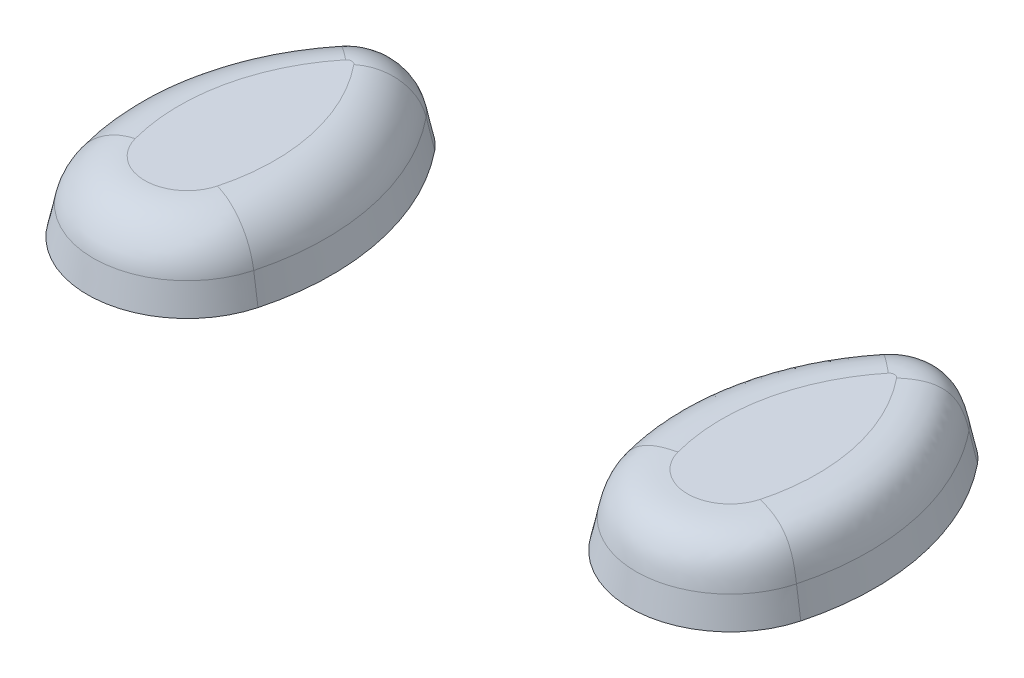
ISO-10303-21;
HEADER;
FILE_DESCRIPTION(('STEP AP214'),'2;1');
FILE_NAME('part.step','',(''),(''),'','','');
FILE_SCHEMA(('AUTOMOTIVE_DESIGN { 1 0 10303 214 1 1 1 1 }'));
ENDSEC;
DATA;
#1=APPLICATION_CONTEXT('core data for automotive mechanical design processes');
#2=APPLICATION_PROTOCOL_DEFINITION('international standard','automotive_design',2000,#1);
#3=PRODUCT_CONTEXT('',#1,'mechanical');
#4=PRODUCT('Part','Part','',(#3));
#5=PRODUCT_RELATED_PRODUCT_CATEGORY('part','',(#4));
#6=PRODUCT_DEFINITION_FORMATION('','',#4);
#7=PRODUCT_DEFINITION_CONTEXT('part definition',#1,'design');
#8=PRODUCT_DEFINITION('design','',#6,#7);
#9=PRODUCT_DEFINITION_SHAPE('','',#8);
#10=(LENGTH_UNIT() NAMED_UNIT(*) SI_UNIT(.MILLI.,.METRE.));
#11=(NAMED_UNIT(*) PLANE_ANGLE_UNIT() SI_UNIT($,.RADIAN.));
#12=(NAMED_UNIT(*) SI_UNIT($,.STERADIAN.) SOLID_ANGLE_UNIT());
#13=UNCERTAINTY_MEASURE_WITH_UNIT(LENGTH_MEASURE(1.E-05),#10,'distance_accuracy_value','');
#14=(GEOMETRIC_REPRESENTATION_CONTEXT(3) GLOBAL_UNCERTAINTY_ASSIGNED_CONTEXT((#13)) GLOBAL_UNIT_ASSIGNED_CONTEXT((#10,
#11,#12)) REPRESENTATION_CONTEXT('',''));
#15=CARTESIAN_POINT('',(0.,0.,0.));
#16=DIRECTION('',(0.,0.,1.));
#17=DIRECTION('',(1.,0.,0.));
#18=AXIS2_PLACEMENT_3D('',#15,#16,#17);
#19=CARTESIAN_POINT('',(-250.096220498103,0.,13.1217419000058));
#20=DIRECTION('',(0.,-1.,0.));
#21=DIRECTION('',(0.,0.,1.));
#22=AXIS2_PLACEMENT_3D('',#19,#20,#21);
#23=CONICAL_SURFACE('',#22,91.5692526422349,0.20943951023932);
#24=DIRECTION('',(0.161516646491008,-0.978147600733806,-0.130918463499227));
#25=VECTOR('',#24,1.);
#26=CARTESIAN_POINT('',(-178.960448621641,0.,-44.5378625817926));
#27=LINE('',#26,#25);
#28=CARTESIAN_POINT('',(-180.663006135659,10.3107177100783,-43.1578425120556));
#29=VERTEX_POINT('',#28);
#30=CARTESIAN_POINT('',(-178.960448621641,0.,-44.5378625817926));
#31=VERTEX_POINT('',#30);
#32=EDGE_CURVE('E122',#29,#31,#27,.T.);
#33=ORIENTED_EDGE('',*,*,#32,.F.);
#34=CARTESIAN_POINT('',(-250.096220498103,10.3107177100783,13.1217419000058));
#35=DIRECTION('',(0.,-1.,0.));
#36=DIRECTION('',(0.,0.,-1.));
#37=AXIS2_PLACEMENT_3D('',#34,#35,#36);
#38=CIRCLE('',#37,89.3776419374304);
#39=CARTESIAN_POINT('',(-163.761254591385,10.3107177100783,36.2439507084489));
#40=VERTEX_POINT('',#39);
#41=EDGE_CURVE('E100',#29,#40,#38,.T.);
#42=ORIENTED_EDGE('',*,*,#41,.T.);
#43=DIRECTION('',(0.200833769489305,-0.978147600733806,0.0537872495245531));
#44=VECTOR('',#43,1.);
#45=CARTESIAN_POINT('',(-161.64425271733,0.,36.8109256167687));
#46=LINE('',#45,#44);
#47=CARTESIAN_POINT('',(-161.64425271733,0.,36.8109256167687));
#48=VERTEX_POINT('',#47);
#49=EDGE_CURVE('E94',#40,#48,#46,.T.);
#50=ORIENTED_EDGE('',*,*,#49,.T.);
#51=CARTESIAN_POINT('',(-250.096220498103,0.,13.1217419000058));
#52=DIRECTION('',(0.,-1.,0.));
#53=DIRECTION('',(0.,0.,1.));
#54=AXIS2_PLACEMENT_3D('',#51,#52,#53);
#55=CIRCLE('',#54,91.5692526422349);
#56=EDGE_CURVE('E98',#31,#48,#55,.T.);
#57=ORIENTED_EDGE('',*,*,#56,.F.);
#58=EDGE_LOOP('',(#33,#42,#50,#57));
#59=FACE_BOUND('',#58,.T.);
#60=ADVANCED_FACE('F43',(#59),#23,.T.);
#61=CARTESIAN_POINT('',(-196.639392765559,0.,27.4385360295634));
#62=DIRECTION('',(0.,-1.,0.));
#63=DIRECTION('',(0.,0.,-1.));
#64=AXIS2_PLACEMENT_3D('',#61,#62,#63);
#65=CONICAL_SURFACE('',#64,36.228462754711,0.20943951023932);
#66=ORIENTED_EDGE('',*,*,#49,.F.);
#67=CARTESIAN_POINT('',(-196.639392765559,10.3107177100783,27.4385360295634));
#68=DIRECTION('',(0.,-1.,0.));
#69=DIRECTION('',(0.,0.,-1.));
#70=AXIS2_PLACEMENT_3D('',#67,#68,#69);
#71=CIRCLE('',#70,34.0368520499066);
#72=CARTESIAN_POINT('',(-229.517530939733,10.3107177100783,36.243950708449));
#73=VERTEX_POINT('',#72);
#74=EDGE_CURVE('E12',#40,#73,#71,.T.);
#75=ORIENTED_EDGE('',*,*,#74,.T.);
#76=DIRECTION('',(-0.200833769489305,-0.978147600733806,0.053787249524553));
#77=VECTOR('',#76,1.);
#78=CARTESIAN_POINT('',(-231.634532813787,0.,36.8109256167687));
#79=LINE('',#78,#77);
#80=CARTESIAN_POINT('',(-231.634532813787,0.,36.8109256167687));
#81=VERTEX_POINT('',#80);
#82=EDGE_CURVE('E101',#73,#81,#79,.T.);
#83=ORIENTED_EDGE('',*,*,#82,.T.);
#84=CARTESIAN_POINT('',(-196.639392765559,0.,27.4385360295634));
#85=DIRECTION('',(0.,-1.,0.));
#86=DIRECTION('',(0.,0.,-1.));
#87=AXIS2_PLACEMENT_3D('',#84,#85,#86);
#88=CIRCLE('',#87,36.228462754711);
#89=EDGE_CURVE('E104',#48,#81,#88,.T.);
#90=ORIENTED_EDGE('',*,*,#89,.F.);
#91=EDGE_LOOP('',(#66,#75,#83,#90));
#92=FACE_BOUND('',#91,.T.);
#93=ADVANCED_FACE('F45',(#92),#65,.T.);
#94=CARTESIAN_POINT('',(-143.182565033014,0.,13.1217419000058));
#95=DIRECTION('',(0.,-1.,0.));
#96=DIRECTION('',(0.,0.,-1.));
#97=AXIS2_PLACEMENT_3D('',#94,#95,#96);
#98=CONICAL_SURFACE('',#97,91.5692526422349,0.20943951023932);
#99=ORIENTED_EDGE('',*,*,#82,.F.);
#100=CARTESIAN_POINT('',(-143.182565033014,10.3107177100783,13.1217419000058));
#101=DIRECTION('',(0.,-1.,0.));
#102=DIRECTION('',(0.,0.,-1.));
#103=AXIS2_PLACEMENT_3D('',#100,#101,#102);
#104=CIRCLE('',#103,89.3776419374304);
#105=CARTESIAN_POINT('',(-212.615779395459,10.3107177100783,-43.1578425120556));
#106=VERTEX_POINT('',#105);
#107=EDGE_CURVE('E51',#73,#106,#104,.T.);
#108=ORIENTED_EDGE('',*,*,#107,.T.);
#109=DIRECTION('',(-0.161516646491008,-0.978147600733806,-0.130918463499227));
#110=VECTOR('',#109,1.);
#111=CARTESIAN_POINT('',(-214.318336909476,0.,-44.5378625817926));
#112=LINE('',#111,#110);
#113=CARTESIAN_POINT('',(-214.318336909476,0.,-44.5378625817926));
#114=VERTEX_POINT('',#113);
#115=EDGE_CURVE('E125',#106,#114,#112,.T.);
#116=ORIENTED_EDGE('',*,*,#115,.T.);
#117=CARTESIAN_POINT('',(-143.182565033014,0.,13.1217419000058));
#118=DIRECTION('',(0.,-1.,0.));
#119=DIRECTION('',(0.,0.,-1.));
#120=AXIS2_PLACEMENT_3D('',#117,#118,#119);
#121=CIRCLE('',#120,91.5692526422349);
#122=EDGE_CURVE('E108',#81,#114,#121,.T.);
#123=ORIENTED_EDGE('',*,*,#122,.F.);
#124=EDGE_LOOP('',(#99,#108,#116,#123));
#125=FACE_BOUND('',#124,.T.);
#126=ADVANCED_FACE('F172',(#125),#98,.T.);
#127=CARTESIAN_POINT('',(-196.639392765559,0.,-30.2080690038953));
#128=DIRECTION('',(0.,-1.,0.));
#129=DIRECTION('',(0.,0.,-1.));
#130=AXIS2_PLACEMENT_3D('',#127,#128,#129);
#131=CONICAL_SURFACE('',#130,22.7571538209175,0.20943951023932);
#132=ORIENTED_EDGE('',*,*,#115,.F.);
#133=CARTESIAN_POINT('',(-196.639392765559,10.3107177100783,-30.2080690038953));
#134=DIRECTION('',(0.,-1.,0.));
#135=DIRECTION('',(0.,0.,-1.));
#136=AXIS2_PLACEMENT_3D('',#133,#134,#135);
#137=CIRCLE('',#136,20.565543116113);
#138=EDGE_CURVE('E138',#106,#29,#137,.T.);
#139=ORIENTED_EDGE('',*,*,#138,.T.);
#140=ORIENTED_EDGE('',*,*,#32,.T.);
#141=CARTESIAN_POINT('',(-196.639392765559,0.,-30.2080690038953));
#142=DIRECTION('',(0.,-1.,0.));
#143=DIRECTION('',(0.,0.,-1.));
#144=AXIS2_PLACEMENT_3D('',#141,#142,#143);
#145=CIRCLE('',#144,22.7571538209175);
#146=EDGE_CURVE('E113',#114,#31,#145,.T.);
#147=ORIENTED_EDGE('',*,*,#146,.F.);
#148=EDGE_LOOP('',(#132,#139,#140,#147));
#149=FACE_BOUND('',#148,.T.);
#150=ADVANCED_FACE('F141',(#149),#131,.T.);
#151=CARTESIAN_POINT('',(-223.367806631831,25.4,20.2801389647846));
#152=DIRECTION('',(0.,1.,0.));
#153=DIRECTION('',(0.,0.,1.));
#154=AXIS2_PLACEMENT_3D('',#151,#152,#153);
#155=PLANE('',#154);
#156=CARTESIAN_POINT('',(-196.639392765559,25.4,27.4385360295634));
#157=DIRECTION('',(0.,1.,0.));
#158=DIRECTION('',(0.,0.,1.));
#159=AXIS2_PLACEMENT_3D('',#156,#157,#158);
#160=CIRCLE('',#159,15.4031402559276);
#161=CARTESIAN_POINT('',(-211.518165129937,25.4,31.4233650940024));
#162=VERTEX_POINT('',#161);
#163=CARTESIAN_POINT('',(-181.760620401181,25.4,31.4233650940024));
#164=VERTEX_POINT('',#163);
#165=EDGE_CURVE('E129',#162,#164,#160,.T.);
#166=ORIENTED_EDGE('',*,*,#165,.T.);
#167=CARTESIAN_POINT('',(-250.096220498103,25.4,13.1217419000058));
#168=DIRECTION('',(0.,1.,0.));
#169=DIRECTION('',(0.,0.,1.));
#170=AXIS2_PLACEMENT_3D('',#167,#168,#169);
#171=CIRCLE('',#170,70.7439301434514);
#172=CARTESIAN_POINT('',(-195.13864542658,25.4,-31.424510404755));
#173=VERTEX_POINT('',#172);
#174=EDGE_CURVE('E135',#164,#173,#171,.T.);
#175=ORIENTED_EDGE('',*,*,#174,.T.);
#176=CARTESIAN_POINT('',(-196.639392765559,25.4,-30.2080690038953));
#177=DIRECTION('',(0.,1.,0.));
#178=DIRECTION('',(0.,0.,1.));
#179=AXIS2_PLACEMENT_3D('',#176,#177,#178);
#180=CIRCLE('',#179,1.93183132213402);
#181=CARTESIAN_POINT('',(-198.140140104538,25.4,-31.424510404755));
#182=VERTEX_POINT('',#181);
#183=EDGE_CURVE('E133',#173,#182,#180,.T.);
#184=ORIENTED_EDGE('',*,*,#183,.T.);
#185=CARTESIAN_POINT('',(-143.182565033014,25.4,13.1217419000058));
#186=DIRECTION('',(0.,1.,0.));
#187=DIRECTION('',(0.,0.,1.));
#188=AXIS2_PLACEMENT_3D('',#185,#186,#187);
#189=CIRCLE('',#188,70.7439301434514);
#190=EDGE_CURVE('E131',#182,#162,#189,.T.);
#191=ORIENTED_EDGE('',*,*,#190,.T.);
#192=EDGE_LOOP('',(#166,#175,#184,#191));
#193=FACE_BOUND('',#192,.T.);
#194=ADVANCED_FACE('F164',(#193),#155,.T.);
#195=CARTESIAN_POINT('',(-223.367806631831,0.,20.2801389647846));
#196=DIRECTION('',(0.,1.,0.));
#197=DIRECTION('',(0.,0.,1.));
#198=AXIS2_PLACEMENT_3D('',#195,#196,#197);
#199=PLANE('',#198);
#200=ORIENTED_EDGE('',*,*,#56,.T.);
#201=ORIENTED_EDGE('',*,*,#89,.T.);
#202=ORIENTED_EDGE('',*,*,#122,.T.);
#203=ORIENTED_EDGE('',*,*,#146,.T.);
#204=EDGE_LOOP('',(#200,#201,#202,#203));
#205=FACE_BOUND('',#204,.T.);
#206=ADVANCED_FACE('F111',(#205),#199,.F.);
#207=CARTESIAN_POINT('',(-143.182565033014,6.35,13.1217419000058));
#208=DIRECTION('',(0.,1.,0.));
#209=DIRECTION('',(0.,0.,1.));
#210=AXIS2_PLACEMENT_3D('',#207,#208,#209);
#211=TOROIDAL_SURFACE('',#210,70.7439301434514,19.05);
#212=CARTESIAN_POINT('',(-211.518165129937,6.35,31.4233650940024));
#213=DIRECTION('',(0.258702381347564,0.,0.965957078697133));
#214=DIRECTION('',(0.965957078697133,0.,-0.258702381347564));
#215=AXIS2_PLACEMENT_3D('',#212,#213,#214);
#216=CIRCLE('',#215,19.05);
#217=EDGE_CURVE('E117',#162,#73,#216,.T.);
#218=ORIENTED_EDGE('',*,*,#217,.F.);
#219=ORIENTED_EDGE('',*,*,#190,.F.);
#220=CARTESIAN_POINT('',(-198.140140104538,6.35,-31.4245104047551));
#221=DIRECTION('',(0.629683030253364,0.,-0.776852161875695));
#222=DIRECTION('',(-0.776852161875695,0.,-0.629683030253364));
#223=AXIS2_PLACEMENT_3D('',#220,#221,#222);
#224=CIRCLE('',#223,19.05);
#225=EDGE_CURVE('E114',#106,#182,#224,.T.);
#226=ORIENTED_EDGE('',*,*,#225,.F.);
#227=ORIENTED_EDGE('',*,*,#107,.F.);
#228=EDGE_LOOP('',(#218,#219,#226,#227));
#229=FACE_BOUND('',#228,.T.);
#230=ADVANCED_FACE('F162',(#229),#211,.T.);
#231=CARTESIAN_POINT('',(-196.639392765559,6.35,-30.2080690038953));
#232=DIRECTION('',(0.,1.,0.));
#233=DIRECTION('',(0.,0.,1.));
#234=AXIS2_PLACEMENT_3D('',#231,#232,#233);
#235=DEGENERATE_TOROIDAL_SURFACE('',#234,1.93183132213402,19.05,.T.);
#236=ORIENTED_EDGE('',*,*,#225,.T.);
#237=ORIENTED_EDGE('',*,*,#183,.F.);
#238=CARTESIAN_POINT('',(-195.13864542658,6.35,-31.424510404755));
#239=DIRECTION('',(0.629683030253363,0.,0.776852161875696));
#240=DIRECTION('',(0.776852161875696,0.,-0.629683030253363));
#241=AXIS2_PLACEMENT_3D('',#238,#239,#240);
#242=CIRCLE('',#241,19.05);
#243=EDGE_CURVE('E146',#29,#173,#242,.T.);
#244=ORIENTED_EDGE('',*,*,#243,.F.);
#245=ORIENTED_EDGE('',*,*,#138,.F.);
#246=EDGE_LOOP('',(#236,#237,#244,#245));
#247=FACE_BOUND('',#246,.T.);
#248=ADVANCED_FACE('F147',(#247),#235,.T.);
#249=CARTESIAN_POINT('',(-196.639392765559,6.35,27.4385360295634));
#250=DIRECTION('',(0.,1.,0.));
#251=DIRECTION('',(0.,0.,1.));
#252=AXIS2_PLACEMENT_3D('',#249,#250,#251);
#253=DEGENERATE_TOROIDAL_SURFACE('',#252,15.4031402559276,19.05,.T.);
#254=ORIENTED_EDGE('',*,*,#217,.T.);
#255=ORIENTED_EDGE('',*,*,#74,.F.);
#256=CARTESIAN_POINT('',(-181.760620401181,6.35,31.4233650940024));
#257=DIRECTION('',(0.258702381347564,0.,-0.965957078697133));
#258=DIRECTION('',(-0.965957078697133,0.,-0.258702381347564));
#259=AXIS2_PLACEMENT_3D('',#256,#257,#258);
#260=CIRCLE('',#259,19.05);
#261=EDGE_CURVE('E150',#164,#40,#260,.T.);
#262=ORIENTED_EDGE('',*,*,#261,.F.);
#263=ORIENTED_EDGE('',*,*,#165,.F.);
#264=EDGE_LOOP('',(#254,#255,#262,#263));
#265=FACE_BOUND('',#264,.T.);
#266=ADVANCED_FACE('F158',(#265),#253,.T.);
#267=CARTESIAN_POINT('',(-250.096220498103,6.35,13.1217419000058));
#268=DIRECTION('',(0.,1.,0.));
#269=DIRECTION('',(0.,0.,1.));
#270=AXIS2_PLACEMENT_3D('',#267,#268,#269);
#271=TOROIDAL_SURFACE('',#270,70.7439301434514,19.05);
#272=ORIENTED_EDGE('',*,*,#243,.T.);
#273=ORIENTED_EDGE('',*,*,#174,.F.);
#274=ORIENTED_EDGE('',*,*,#261,.T.);
#275=ORIENTED_EDGE('',*,*,#41,.F.);
#276=EDGE_LOOP('',(#272,#273,#274,#275));
#277=FACE_BOUND('',#276,.T.);
#278=ADVANCED_FACE('F152',(#277),#271,.T.);
#279=CLOSED_SHELL('',(#60,#93,#126,#150,#194,#206,#230,#248,#266,#278));
#280=MANIFOLD_SOLID_BREP('B2',#279);
#281=CARTESIAN_POINT('',(-14.878772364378,25.4,31.4233650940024));
#282=CARTESIAN_POINT('',(-14.6614124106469,25.4,32.2349555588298));
#283=CARTESIAN_POINT('',(-14.3775057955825,25.4,33.028703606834));
#284=CARTESIAN_POINT('',(-13.6841641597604,25.4,34.5593714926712));
#285=CARTESIAN_POINT('',(-13.2747386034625,25.4,35.2962686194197));
#286=CARTESIAN_POINT('',(-12.3412977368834,25.4,36.6935355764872));
#287=CARTESIAN_POINT('',(-11.8172935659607,25.4,37.3538887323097));
#288=CARTESIAN_POINT('',(-10.6686933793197,25.4,38.5804222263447));
#289=CARTESIAN_POINT('',(-10.0441110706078,25.4,39.1465879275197));
#290=CARTESIAN_POINT('',(-8.71104015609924,25.4,40.1696171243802));
#291=CARTESIAN_POINT('',(-8.0025674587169,25.4,40.6264684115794));
#292=CARTESIAN_POINT('',(-6.52064314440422,25.4,41.4186597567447));
#293=CARTESIAN_POINT('',(-5.74720921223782,25.4,41.7539903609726));
#294=CARTESIAN_POINT('',(-4.15602592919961,25.4,42.2941778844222));
#295=CARTESIAN_POINT('',(-3.33829556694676,25.4,42.4990283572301));
#296=CARTESIAN_POINT('',(-1.68036695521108,25.4,42.7727791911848));
#297=CARTESIAN_POINT('',(-0.840188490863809,25.4,42.8416762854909));
#298=CARTESIAN_POINT('',(0.840188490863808,25.4,42.8416762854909));
#299=CARTESIAN_POINT('',(1.68036695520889,25.4,42.7727791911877));
#300=CARTESIAN_POINT('',(3.33829556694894,25.4,42.4990283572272));
#301=CARTESIAN_POINT('',(4.15602592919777,25.4,42.2941778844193));
#302=CARTESIAN_POINT('',(5.74720921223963,25.4,41.7539903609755));
#303=CARTESIAN_POINT('',(6.52064314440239,25.4,41.4186597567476));
#304=CARTESIAN_POINT('',(8.00256745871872,25.4,40.6264684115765));
#305=CARTESIAN_POINT('',(8.71104015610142,25.4,40.1696171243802));
#306=CARTESIAN_POINT('',(10.0441110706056,25.4,39.1465879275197));
#307=CARTESIAN_POINT('',(10.6686933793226,25.4,38.5804222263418));
#308=CARTESIAN_POINT('',(11.8172935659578,25.4,37.3538887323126));
#309=CARTESIAN_POINT('',(12.3412977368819,25.4,36.6935355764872));
#310=CARTESIAN_POINT('',(13.2747386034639,25.4,35.2962686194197));
#311=CARTESIAN_POINT('',(13.6841641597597,25.4,34.5593714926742));
#312=CARTESIAN_POINT('',(14.3775057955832,25.4,33.0287036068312));
#313=CARTESIAN_POINT('',(14.6614124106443,25.4,32.2349555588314));
#314=CARTESIAN_POINT('',(14.878772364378,25.4,31.4233650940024));
#315=CARTESIAN_POINT('',(-17.4625333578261,25.4,32.1153473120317));
#316=CARTESIAN_POINT('',(-17.2074279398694,25.4,33.0678738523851));
#317=CARTESIAN_POINT('',(-16.87421975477,25.4,33.9994595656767));
#318=CARTESIAN_POINT('',(-16.0604764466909,25.4,35.7959343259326));
#319=CARTESIAN_POINT('',(-15.5799524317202,25.4000000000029,36.6607967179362));
#320=CARTESIAN_POINT('',(-14.4844156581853,25.3999999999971,38.300704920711));
#321=CARTESIAN_POINT('',(-13.8694159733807,25.4,39.0757311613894));
#322=CARTESIAN_POINT('',(-12.5213565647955,25.4,40.5152573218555));
#323=CARTESIAN_POINT('',(-11.7883129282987,25.3999999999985,41.1797400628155));
#324=CARTESIAN_POINT('',(-10.2237486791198,25.4000000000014,42.3804225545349));
#325=CARTESIAN_POINT('',(-9.39224673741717,25.4000000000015,42.9166079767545));
#326=CARTESIAN_POINT('',(-7.65298007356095,25.3999999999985,43.8463666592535));
#327=CARTESIAN_POINT('',(-6.74523610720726,25.4,44.2399288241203));
#328=CARTESIAN_POINT('',(-4.87773719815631,25.4,44.8739221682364));
#329=CARTESIAN_POINT('',(-3.91800454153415,25.4,45.1143457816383));
#330=CARTESIAN_POINT('',(-1.97216969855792,25.4,45.4356345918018));
#331=CARTESIAN_POINT('',(-0.986090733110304,25.4,45.516495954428));
#332=CARTESIAN_POINT('',(0.986090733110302,25.4,45.516495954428));
#333=CARTESIAN_POINT('',(1.97216969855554,25.4,45.4356345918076));
#334=CARTESIAN_POINT('',(3.9180045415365,25.4,45.1143457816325));
#335=CARTESIAN_POINT('',(4.87773719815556,25.4,44.8739221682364));
#336=CARTESIAN_POINT('',(6.74523610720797,25.4,44.2399288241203));
#337=CARTESIAN_POINT('',(7.65298007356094,25.3999999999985,43.8463666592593));
#338=CARTESIAN_POINT('',(9.39224673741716,25.4000000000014,42.9166079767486));
#339=CARTESIAN_POINT('',(10.2237486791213,25.4,42.3804225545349));
#340=CARTESIAN_POINT('',(11.7883129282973,25.4,41.1797400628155));
#341=CARTESIAN_POINT('',(12.5213565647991,25.4,40.5152573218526));
#342=CARTESIAN_POINT('',(13.869415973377,25.4,39.0757311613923));
#343=CARTESIAN_POINT('',(14.484415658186,25.4,38.300704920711));
#344=CARTESIAN_POINT('',(15.5799524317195,25.4,36.6607967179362));
#345=CARTESIAN_POINT('',(16.0604764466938,25.4,35.7959343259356));
#346=CARTESIAN_POINT('',(16.8742197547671,25.4,33.9994595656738));
#347=CARTESIAN_POINT('',(17.2074279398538,25.4000000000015,33.0678738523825));
#348=CARTESIAN_POINT('',(17.4625333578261,25.4,32.1153473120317));
#349=CARTESIAN_POINT('',(-20.0462943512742,25.4,32.807329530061));
#350=CARTESIAN_POINT('',(-19.7534434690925,25.4,33.9007921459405));
#351=CARTESIAN_POINT('',(-19.3709337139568,25.4,34.9702155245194));
#352=CARTESIAN_POINT('',(-18.436788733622,25.4,37.032497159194));
#353=CARTESIAN_POINT('',(-17.8851662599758,25.4000000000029,38.0253248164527));
#354=CARTESIAN_POINT('',(-16.6275335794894,25.3999999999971,39.9078742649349));
#355=CARTESIAN_POINT('',(-15.9215383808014,25.4,40.797573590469));
#356=CARTESIAN_POINT('',(-14.3740197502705,25.4,42.4500924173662));
#357=CARTESIAN_POINT('',(-13.5325147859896,25.3999999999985,43.2128921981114));
#358=CARTESIAN_POINT('',(-11.7364572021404,25.4000000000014,44.5912279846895));
#359=CARTESIAN_POINT('',(-10.7819260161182,25.4,45.2067475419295));
#360=CARTESIAN_POINT('',(-8.78531700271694,25.4,46.2740735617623));
#361=CARTESIAN_POINT('',(-7.74326300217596,25.4,46.725867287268));
#362=CARTESIAN_POINT('',(-5.59944846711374,25.4,47.4536664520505));
#363=CARTESIAN_POINT('',(-4.49771351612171,25.4,47.7296632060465));
#364=CARTESIAN_POINT('',(-2.26397244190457,25.4,48.0984899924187));
#365=CARTESIAN_POINT('',(-1.1319929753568,25.4,48.1913156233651));
#366=CARTESIAN_POINT('',(1.1319929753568,25.4,48.1913156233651));
#367=CARTESIAN_POINT('',(2.263972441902,25.3999999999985,48.0984899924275));
#368=CARTESIAN_POINT('',(4.49771351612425,25.4000000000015,47.7296632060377));
#369=CARTESIAN_POINT('',(5.59944846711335,25.3999999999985,47.4536664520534));
#370=CARTESIAN_POINT('',(7.74326300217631,25.4000000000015,46.7258672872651));
#371=CARTESIAN_POINT('',(8.78531700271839,25.3999999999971,46.2740735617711));
#372=CARTESIAN_POINT('',(10.7819260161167,25.4000000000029,45.2067475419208));
#373=CARTESIAN_POINT('',(11.7364572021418,25.4,44.5912279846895));
#374=CARTESIAN_POINT('',(13.5325147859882,25.4,43.2128921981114));
#375=CARTESIAN_POINT('',(14.3740197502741,25.4000000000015,42.4500924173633));
#376=CARTESIAN_POINT('',(15.9215383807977,25.3999999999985,40.797573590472));
#377=CARTESIAN_POINT('',(16.6275335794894,25.3999999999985,39.9078742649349));
#378=CARTESIAN_POINT('',(17.8851662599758,25.4000000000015,38.0253248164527));
#379=CARTESIAN_POINT('',(18.4367887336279,25.3999999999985,37.0324971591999));
#380=CARTESIAN_POINT('',(19.370933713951,25.4000000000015,34.9702155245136));
#381=CARTESIAN_POINT('',(19.7534434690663,25.4000000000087,33.9007921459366));
#382=CARTESIAN_POINT('',(20.0462943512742,25.4,32.807329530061));
#383=CARTESIAN_POINT('',(-25.7846167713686,24.4401457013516,34.3441655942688));
#384=CARTESIAN_POINT('',(-25.4079362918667,24.4401457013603,35.7506357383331));
#385=CARTESIAN_POINT('',(-24.9159317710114,24.4401457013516,37.1261853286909));
#386=CARTESIAN_POINT('',(-23.7143844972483,24.4401457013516,39.7788023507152));
#387=CARTESIAN_POINT('',(-23.0048581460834,24.4401457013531,41.0558304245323));
#388=CARTESIAN_POINT('',(-21.3872236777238,24.4401457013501,43.4772662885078));
#389=CARTESIAN_POINT('',(-20.4791348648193,24.4401457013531,44.6216451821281));
#390=CARTESIAN_POINT('',(-18.4886335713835,24.4401457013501,46.7472033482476));
#391=CARTESIAN_POINT('',(-17.4062448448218,24.4401457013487,47.7283572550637));
#392=CARTESIAN_POINT('',(-15.0960594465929,24.4401457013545,49.5012465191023));
#393=CARTESIAN_POINT('',(-13.8682903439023,24.4401457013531,50.2929607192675));
#394=CARTESIAN_POINT('',(-11.300144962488,24.4401457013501,51.6658125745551));
#395=CARTESIAN_POINT('',(-9.95979933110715,24.4401457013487,52.2469338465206));
#396=CARTESIAN_POINT('',(-7.20231032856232,24.4401457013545,53.1830680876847));
#397=CARTESIAN_POINT('',(-5.78519986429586,24.4401457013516,53.5380698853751));
#398=CARTESIAN_POINT('',(-2.91204253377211,24.4401457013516,54.012474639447));
#399=CARTESIAN_POINT('',(-1.45602995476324,24.4401457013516,54.1318719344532));
#400=CARTESIAN_POINT('',(1.45602995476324,24.4401457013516,54.1318719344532));
#401=CARTESIAN_POINT('',(2.91204253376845,24.4401457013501,54.0124746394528));
#402=CARTESIAN_POINT('',(5.78519986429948,24.440145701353,53.5380698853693));
#403=CARTESIAN_POINT('',(7.20231032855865,24.4401457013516,53.1830680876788));
#404=CARTESIAN_POINT('',(9.95979933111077,24.4401457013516,52.2469338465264));
#405=CARTESIAN_POINT('',(11.3001449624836,24.4401457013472,51.6658125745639));
#406=CARTESIAN_POINT('',(13.8682903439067,24.440145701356,50.2929607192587));
#407=CARTESIAN_POINT('',(15.0960594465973,24.4401457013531,49.5012465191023));
#408=CARTESIAN_POINT('',(17.4062448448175,24.4401457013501,47.7283572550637));
#409=CARTESIAN_POINT('',(18.4886335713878,24.4401457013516,46.7472033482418));
#410=CARTESIAN_POINT('',(20.4791348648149,24.4401457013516,44.6216451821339));
#411=CARTESIAN_POINT('',(21.3872236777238,24.4401457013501,43.4772662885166));
#412=CARTESIAN_POINT('',(23.0048581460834,24.4401457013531,41.0558304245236));
#413=CARTESIAN_POINT('',(23.7143844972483,24.4401457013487,39.778802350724));
#414=CARTESIAN_POINT('',(24.9159317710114,24.4401457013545,37.1261853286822));
#415=CARTESIAN_POINT('',(25.4079362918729,24.4401457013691,35.7506357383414));
#416=CARTESIAN_POINT('',(25.7846167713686,24.4401457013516,34.3441655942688));
#417=CARTESIAN_POINT('',(-29.7037686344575,21.1546305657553,35.3937918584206));
#418=CARTESIAN_POINT('',(-29.2698343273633,21.1546305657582,37.0140394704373));
#419=CARTESIAN_POINT('',(-28.7030472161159,21.1546305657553,38.598666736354));
#420=CARTESIAN_POINT('',(-27.3188698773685,21.1546305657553,41.6544702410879));
#421=CARTESIAN_POINT('',(-26.5014985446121,21.1546305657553,43.1256011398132));
#422=CARTESIAN_POINT('',(-24.6379905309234,21.1546305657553,45.915084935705));
#423=CARTESIAN_POINT('',(-23.5918760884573,21.1546305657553,47.2334045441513));
#424=CARTESIAN_POINT('',(-21.2988270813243,21.1546305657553,49.6820384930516));
#425=CARTESIAN_POINT('',(-20.0519198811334,21.1546305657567,50.8123236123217));
#426=CARTESIAN_POINT('',(-17.3905961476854,21.1546305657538,52.8546844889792));
#427=CARTESIAN_POINT('',(-15.9762113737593,21.1546305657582,53.7667358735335));
#428=CARTESIAN_POINT('',(-13.0177188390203,21.1546305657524,55.3482553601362));
#429=CARTESIAN_POINT('',(-11.4736463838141,21.1546305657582,56.0177045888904));
#430=CARTESIAN_POINT('',(-8.29703080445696,21.1546305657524,57.0961272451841));
#431=CARTESIAN_POINT('',(-6.66452558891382,21.1546305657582,57.5050878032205));
#432=CARTESIAN_POINT('',(-3.35466058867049,21.1546305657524,58.05160005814));
#433=CARTESIAN_POINT('',(-1.67734030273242,21.1546305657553,58.1891452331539));
#434=CARTESIAN_POINT('',(1.67734030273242,21.1546305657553,58.1891452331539));
#435=CARTESIAN_POINT('',(3.3546605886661,21.1546305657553,58.0516000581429));
#436=CARTESIAN_POINT('',(6.66452558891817,21.1546305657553,57.5050878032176));
#437=CARTESIAN_POINT('',(8.29703080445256,21.1546305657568,57.0961272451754));
#438=CARTESIAN_POINT('',(11.4736463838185,21.1546305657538,56.0177045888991));
#439=CARTESIAN_POINT('',(13.0177188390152,21.1546305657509,55.3482553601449));
#440=CARTESIAN_POINT('',(15.9762113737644,21.1546305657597,53.7667358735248));
#441=CARTESIAN_POINT('',(17.3905961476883,21.1546305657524,52.8546844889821));
#442=CARTESIAN_POINT('',(20.0519198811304,21.1546305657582,50.8123236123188));
#443=CARTESIAN_POINT('',(21.2988270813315,21.1546305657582,49.6820384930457));
#444=CARTESIAN_POINT('',(23.59187608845,21.1546305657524,47.2334045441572));
#445=CARTESIAN_POINT('',(24.6379905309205,21.1546305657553,45.915084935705));
#446=CARTESIAN_POINT('',(26.501498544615,21.1546305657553,43.1256011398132));
#447=CARTESIAN_POINT('',(27.318869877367,21.1546305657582,41.6544702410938));
#448=CARTESIAN_POINT('',(28.7030472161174,21.1546305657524,38.5986667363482));
#449=CARTESIAN_POINT('',(29.269834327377,21.1546305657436,37.0140394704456));
#450=CARTESIAN_POINT('',(29.7037686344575,21.1546305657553,35.3937918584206));
#451=CARTESIAN_POINT('',(-31.8037499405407,15.5434545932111,35.9562083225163));
#452=CARTESIAN_POINT('',(-31.3391375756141,15.5434545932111,37.6910033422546));
#453=CARTESIAN_POINT('',(-30.7322800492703,15.5434545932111,39.3876597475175));
#454=CARTESIAN_POINT('',(-29.2502448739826,15.5434545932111,42.6595008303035));
#455=CARTESIAN_POINT('',(-28.3750874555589,15.543454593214,44.2346369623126));
#456=CARTESIAN_POINT('',(-26.3798341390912,15.5434545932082,47.221330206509));
#457=CARTESIAN_POINT('',(-25.2597620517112,15.5434545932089,48.632851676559));
#458=CARTESIAN_POINT('',(-22.8046002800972,15.5434545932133,51.2545978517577));
#459=CARTESIAN_POINT('',(-21.4695398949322,15.5434545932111,52.4647912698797));
#460=CARTESIAN_POINT('',(-18.6200673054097,15.5434545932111,54.6515418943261));
#461=CARTESIAN_POINT('',(-17.1056891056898,15.5434545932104,55.6280730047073));
#462=CARTESIAN_POINT('',(-13.9380386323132,15.5434545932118,57.3214019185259));
#463=CARTESIAN_POINT('',(-12.2848041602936,15.5434545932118,58.0381795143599));
#464=CARTESIAN_POINT('',(-8.88360989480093,15.5434545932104,59.1928439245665));
#465=CARTESIAN_POINT('',(-7.13569068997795,15.5434545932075,59.6307169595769));
#466=CARTESIAN_POINT('',(-3.59182660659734,15.5434545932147,60.2158662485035));
#467=CARTESIAN_POINT('',(-1.79592401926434,15.5434545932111,60.3631355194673));
#468=CARTESIAN_POINT('',(1.79592401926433,15.5434545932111,60.3631355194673));
#469=CARTESIAN_POINT('',(3.59182660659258,15.5434545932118,60.2158662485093));
#470=CARTESIAN_POINT('',(7.13569068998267,15.5434545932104,59.630716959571));
#471=CARTESIAN_POINT('',(8.88360989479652,15.5434545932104,59.1928439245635));
#472=CARTESIAN_POINT('',(12.284804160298,15.5434545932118,58.0381795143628));
#473=CARTESIAN_POINT('',(13.9380386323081,15.543454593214,57.3214019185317));
#474=CARTESIAN_POINT('',(17.1056891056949,15.5434545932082,55.6280730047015));
#475=CARTESIAN_POINT('',(18.6200673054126,15.5434545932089,54.6515418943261));
#476=CARTESIAN_POINT('',(21.4695398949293,15.5434545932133,52.4647912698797));
#477=CARTESIAN_POINT('',(22.8046002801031,15.5434545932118,51.2545978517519));
#478=CARTESIAN_POINT('',(25.2597620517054,15.5434545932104,48.6328516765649));
#479=CARTESIAN_POINT('',(26.3798341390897,15.5434545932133,47.2213302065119));
#480=CARTESIAN_POINT('',(28.3750874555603,15.5434545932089,44.2346369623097));
#481=CARTESIAN_POINT('',(29.2502448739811,15.5434545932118,42.6595008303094));
#482=CARTESIAN_POINT('',(30.7322800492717,15.5434545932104,39.3876597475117));
#483=CARTESIAN_POINT('',(31.3391375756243,15.5434545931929,37.6910033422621));
#484=CARTESIAN_POINT('',(31.8037499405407,15.5434545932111,35.9562083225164));
#485=CARTESIAN_POINT('',(-32.3409440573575,12.9270861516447,36.1000795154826));
#486=CARTESIAN_POINT('',(-31.8684839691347,12.9270861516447,37.8641767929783));
#487=CARTESIAN_POINT('',(-31.2513760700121,12.9270861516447,39.5894912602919));
#488=CARTESIAN_POINT('',(-29.7443079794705,12.9270861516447,42.9165966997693));
#489=CARTESIAN_POINT('',(-28.8543683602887,12.9270861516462,44.5183383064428));
#490=CARTESIAN_POINT('',(-26.8254134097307,12.9270861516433,47.5554795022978));
#491=CARTESIAN_POINT('',(-25.6864222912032,12.9270861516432,48.9908428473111));
#492=CARTESIAN_POINT('',(-23.189790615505,12.9270861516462,51.6568726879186));
#493=CARTESIAN_POINT('',(-21.832179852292,12.927086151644,52.8875073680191));
#494=CARTESIAN_POINT('',(-18.9345770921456,12.9270861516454,55.1111941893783));
#495=CARTESIAN_POINT('',(-17.3946196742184,12.927086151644,56.1042197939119));
#496=CARTESIAN_POINT('',(-14.1734647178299,12.9270861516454,57.826150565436));
#497=CARTESIAN_POINT('',(-12.4923056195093,12.9270861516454,58.5550351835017));
#498=CARTESIAN_POINT('',(-9.03366210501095,12.927086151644,59.7292029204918));
#499=CARTESIAN_POINT('',(-7.25621896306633,12.9270861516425,60.174472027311));
#500=CARTESIAN_POINT('',(-3.65249580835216,12.9270861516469,60.7695050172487));
#501=CARTESIAN_POINT('',(-1.82625880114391,12.9270861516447,60.9192617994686));
#502=CARTESIAN_POINT('',(1.8262588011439,12.9270861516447,60.9192617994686));
#503=CARTESIAN_POINT('',(3.65249580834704,12.9270861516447,60.7695050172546));
#504=CARTESIAN_POINT('',(7.25621896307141,12.9270861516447,60.1744720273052));
#505=CARTESIAN_POINT('',(9.03366210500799,12.927086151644,59.7292029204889));
#506=CARTESIAN_POINT('',(12.4923056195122,12.9270861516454,58.5550351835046));
#507=CARTESIAN_POINT('',(14.1734647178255,12.9270861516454,57.8261505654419));
#508=CARTESIAN_POINT('',(17.3946196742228,12.927086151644,56.1042197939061));
#509=CARTESIAN_POINT('',(18.9345770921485,12.9270861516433,55.1111941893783));
#510=CARTESIAN_POINT('',(21.8321798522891,12.9270861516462,52.8875073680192));
#511=CARTESIAN_POINT('',(23.1897906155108,12.9270861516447,51.6568726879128));
#512=CARTESIAN_POINT('',(25.6864222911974,12.9270861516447,48.9908428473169));
#513=CARTESIAN_POINT('',(26.8254134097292,12.9270861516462,47.5554795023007));
#514=CARTESIAN_POINT('',(28.8543683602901,12.9270861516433,44.5183383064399));
#515=CARTESIAN_POINT('',(29.744307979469,12.9270861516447,42.9165966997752));
#516=CARTESIAN_POINT('',(31.2513760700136,12.9270861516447,39.5894912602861));
#517=CARTESIAN_POINT('',(31.868483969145,12.9270861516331,37.8641767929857));
#518=CARTESIAN_POINT('',(32.3409440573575,12.9270861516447,36.1000795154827));
#519=CARTESIAN_POINT('',(-32.8781381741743,10.3107177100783,36.2439507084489));
#520=CARTESIAN_POINT('',(-32.397830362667,10.3107177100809,38.0373502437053));
#521=CARTESIAN_POINT('',(-31.7704720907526,10.310717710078,39.7913227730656));
#522=CARTESIAN_POINT('',(-30.2383710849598,10.3107177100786,43.1736925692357));
#523=CARTESIAN_POINT('',(-29.3336492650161,10.3107177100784,44.8020396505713));
#524=CARTESIAN_POINT('',(-27.2709926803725,10.3107177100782,47.8896287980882));
#525=CARTESIAN_POINT('',(-26.1130825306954,10.3107177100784,49.3488340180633));
#526=CARTESIAN_POINT('',(-23.5749809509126,10.3107177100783,52.0591475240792));
#527=CARTESIAN_POINT('',(-22.1948198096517,10.3107177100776,53.3102234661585));
#528=CARTESIAN_POINT('',(-19.2490868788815,10.3107177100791,55.5708464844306));
#529=CARTESIAN_POINT('',(-17.6835502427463,10.310717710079,56.5803665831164));
#530=CARTESIAN_POINT('',(-14.4088908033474,10.3107177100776,58.3308992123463));
#531=CARTESIAN_POINT('',(-12.6998070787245,10.3107177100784,59.071890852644));
#532=CARTESIAN_POINT('',(-9.18371431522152,10.3107177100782,60.2655619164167));
#533=CARTESIAN_POINT('',(-7.3767472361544,10.3107177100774,60.718227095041));
#534=CARTESIAN_POINT('',(-3.71316501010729,10.3107177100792,61.323143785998));
#535=CARTESIAN_POINT('',(-1.85659358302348,10.3107177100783,61.4753880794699));
#536=CARTESIAN_POINT('',(1.85659358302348,10.3107177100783,61.4753880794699));
#537=CARTESIAN_POINT('',(3.7131650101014,10.3107177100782,61.3231437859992));
#538=CARTESIAN_POINT('',(7.37674723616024,10.3107177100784,60.7182270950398));
#539=CARTESIAN_POINT('',(9.1837143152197,10.310717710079,60.2655619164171));
#540=CARTESIAN_POINT('',(12.6998070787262,10.3107177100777,59.0718908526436));
#541=CARTESIAN_POINT('',(14.4088908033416,10.310717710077,58.3308992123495));
#542=CARTESIAN_POINT('',(17.683550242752,10.3107177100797,56.5803665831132));
#543=CARTESIAN_POINT('',(19.2490868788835,10.310717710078,55.5708464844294));
#544=CARTESIAN_POINT('',(22.1948198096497,10.3107177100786,53.3102234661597));
#545=CARTESIAN_POINT('',(23.5749809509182,10.3107177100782,52.0591475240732));
#546=CARTESIAN_POINT('',(26.1130825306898,10.3107177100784,49.3488340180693));
#547=CARTESIAN_POINT('',(27.2709926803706,10.3107177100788,47.8896287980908));
#548=CARTESIAN_POINT('',(29.333649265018,10.3107177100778,44.8020396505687));
#549=CARTESIAN_POINT('',(30.2383710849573,10.3107177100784,43.1736925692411));
#550=CARTESIAN_POINT('',(31.7704720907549,10.3107177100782,39.7913227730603));
#551=CARTESIAN_POINT('',(32.3978303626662,10.3107177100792,38.0373502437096));
#552=CARTESIAN_POINT('',(32.8781381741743,10.3107177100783,36.243950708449));
#553=B_SPLINE_SURFACE_WITH_KNOTS('',5,3,((#281,#282,#283,#284,#285,#286,#287,#288,#289,#290,
#291,#292,#293,#294,#295,#296,#297,#298,#299,#300,#301,#302,#303,#304,#305,#306,#307,#308,#309,
#310,#311,#312,#313,#314),(#315,#316,#317,#318,#319,#320,#321,#322,#323,#324,#325,#326,#327,
#328,#329,#330,#331,#332,#333,#334,#335,#336,#337,#338,#339,#340,#341,#342,#343,#344,#345,#346,
#347,#348),(#349,#350,#351,#352,#353,#354,#355,#356,#357,#358,#359,#360,#361,#362,#363,#364,
#365,#366,#367,#368,#369,#370,#371,#372,#373,#374,#375,#376,#377,#378,#379,#380,#381,#382),
(#383,#384,#385,#386,#387,#388,#389,#390,#391,#392,#393,#394,#395,#396,#397,#398,#399,#400,#401,
#402,#403,#404,#405,#406,#407,#408,#409,#410,#411,#412,#413,#414,#415,#416),(#417,#418,#419,
#420,#421,#422,#423,#424,#425,#426,#427,#428,#429,#430,#431,#432,#433,#434,#435,#436,#437,#438,
#439,#440,#441,#442,#443,#444,#445,#446,#447,#448,#449,#450),(#451,#452,#453,#454,#455,#456,
#457,#458,#459,#460,#461,#462,#463,#464,#465,#466,#467,#468,#469,#470,#471,#472,#473,#474,#475,
#476,#477,#478,#479,#480,#481,#482,#483,#484),(#485,#486,#487,#488,#489,#490,#491,#492,#493,
#494,#495,#496,#497,#498,#499,#500,#501,#502,#503,#504,#505,#506,#507,#508,#509,#510,#511,#512,
#513,#514,#515,#516,#517,#518),(#519,#520,#521,#522,#523,#524,#525,#526,#527,#528,#529,#530,
#531,#532,#533,#534,#535,#536,#537,#538,#539,#540,#541,#542,#543,#544,#545,#546,#547,#548,#549,
#550,#551,#552)),.UNSPECIFIED.,.F.,.F.,.F.,(6,2,6),(4,2,2,2,2,2,2,2,2,2,2,2,2,2,2,2,4),(0.,0.5,
1.),(-1.30911771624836,-1.14547800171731,-0.981838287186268,-0.818198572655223,
-0.654558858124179,-0.490919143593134,-0.327279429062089,-0.163639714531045,0.,
0.163639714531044,0.327279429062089,0.490919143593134,0.654558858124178,0.818198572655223,
0.981838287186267,1.14547800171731,1.30911771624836),.UNSPECIFIED.);
#554=CARTESIAN_POINT('',(14.878772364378,25.4,31.4233650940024));
#555=CARTESIAN_POINT('',(17.4625333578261,25.4,32.1153473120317));
#556=CARTESIAN_POINT('',(20.0462943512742,25.4,32.807329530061));
#557=CARTESIAN_POINT('',(25.7846167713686,24.4401457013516,34.3441655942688));
#558=CARTESIAN_POINT('',(29.7037686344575,21.1546305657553,35.3937918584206));
#559=CARTESIAN_POINT('',(31.8037499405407,15.5434545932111,35.9562083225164));
#560=CARTESIAN_POINT('',(32.3409440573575,12.9270861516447,36.1000795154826));
#561=CARTESIAN_POINT('',(32.8781381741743,10.3107177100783,36.2439507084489));
#562=B_SPLINE_CURVE_WITH_KNOTS('',5,(#554,#555,#556,#557,#558,#559,#560,#561),.UNSPECIFIED.,.F.,
.F.,(6,2,6),(0.,0.5,1.),.UNSPECIFIED.);
#563=CARTESIAN_POINT('',(14.878772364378,25.4,31.4233650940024));
#564=VERTEX_POINT('',#563);
#565=CARTESIAN_POINT('',(32.8781381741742,10.3107177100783,36.243950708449));
#566=VERTEX_POINT('',#565);
#567=EDGE_CURVE('E41',#564,#566,#562,.T.);
#568=CARTESIAN_POINT('',(14.878772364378,25.4,31.4233650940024));
#569=CARTESIAN_POINT('',(14.6614124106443,25.4,32.2349555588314));
#570=CARTESIAN_POINT('',(14.3775057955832,25.4,33.0287036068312));
#571=CARTESIAN_POINT('',(13.6841641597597,25.4,34.5593714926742));
#572=CARTESIAN_POINT('',(13.2747386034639,25.4,35.2962686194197));
#573=CARTESIAN_POINT('',(12.3412977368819,25.4,36.6935355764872));
#574=CARTESIAN_POINT('',(11.8172935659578,25.4,37.3538887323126));
#575=CARTESIAN_POINT('',(10.6686933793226,25.4,38.5804222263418));
#576=CARTESIAN_POINT('',(10.0441110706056,25.4,39.1465879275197));
#577=CARTESIAN_POINT('',(8.71104015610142,25.4,40.1696171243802));
#578=CARTESIAN_POINT('',(8.00256745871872,25.4,40.6264684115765));
#579=CARTESIAN_POINT('',(6.52064314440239,25.4,41.4186597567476));
#580=CARTESIAN_POINT('',(5.74720921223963,25.4,41.7539903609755));
#581=CARTESIAN_POINT('',(4.15602592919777,25.4,42.2941778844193));
#582=CARTESIAN_POINT('',(3.33829556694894,25.4,42.4990283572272));
#583=CARTESIAN_POINT('',(1.68036695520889,25.4,42.7727791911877));
#584=CARTESIAN_POINT('',(0.840188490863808,25.4,42.8416762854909));
#585=CARTESIAN_POINT('',(-0.840188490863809,25.4,42.8416762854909));
#586=CARTESIAN_POINT('',(-1.68036695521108,25.4,42.7727791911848));
#587=CARTESIAN_POINT('',(-3.33829556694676,25.4,42.4990283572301));
#588=CARTESIAN_POINT('',(-4.15602592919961,25.4,42.2941778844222));
#589=CARTESIAN_POINT('',(-5.74720921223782,25.4,41.7539903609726));
#590=CARTESIAN_POINT('',(-6.52064314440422,25.4,41.4186597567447));
#591=CARTESIAN_POINT('',(-8.0025674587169,25.4,40.6264684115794));
#592=CARTESIAN_POINT('',(-8.71104015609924,25.4,40.1696171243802));
#593=CARTESIAN_POINT('',(-10.0441110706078,25.4,39.1465879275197));
#594=CARTESIAN_POINT('',(-10.6686933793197,25.4,38.5804222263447));
#595=CARTESIAN_POINT('',(-11.8172935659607,25.4,37.3538887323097));
#596=CARTESIAN_POINT('',(-12.3412977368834,25.4,36.6935355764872));
#597=CARTESIAN_POINT('',(-13.2747386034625,25.4,35.2962686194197));
#598=CARTESIAN_POINT('',(-13.6841641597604,25.4,34.5593714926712));
#599=CARTESIAN_POINT('',(-14.3775057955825,25.4,33.028703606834));
#600=CARTESIAN_POINT('',(-14.6614124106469,25.4,32.2349555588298));
#601=CARTESIAN_POINT('',(-14.878772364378,25.4,31.4233650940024));
#602=B_SPLINE_CURVE_WITH_KNOTS('',3,(#568,#569,#570,#571,#572,#573,#574,#575,#576,#577,#578,
#579,#580,#581,#582,#583,#584,#585,#586,#587,#588,#589,#590,#591,#592,#593,#594,#595,#596,#597,
#598,#599,#600,#601),.UNSPECIFIED.,.F.,.F.,(4,2,2,2,2,2,2,2,2,2,2,2,2,2,2,2,4),
(-1.30911771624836,-1.14547800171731,-0.981838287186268,-0.818198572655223,-0.654558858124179,
-0.490919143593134,-0.327279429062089,-0.163639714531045,0.,0.163639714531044,0.327279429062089,
0.490919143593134,0.654558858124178,0.818198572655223,0.981838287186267,1.14547800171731,
1.30911771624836),.UNSPECIFIED.);
#603=CARTESIAN_POINT('',(-14.878772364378,25.4,31.4233650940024));
#604=VERTEX_POINT('',#603);
#605=EDGE_CURVE('E316',#604,#564,#602,.F.);
#606=CARTESIAN_POINT('',(-14.878772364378,25.4,31.4233650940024));
#607=CARTESIAN_POINT('',(-17.4625333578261,25.4,32.1153473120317));
#608=CARTESIAN_POINT('',(-20.0462943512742,25.4,32.807329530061));
#609=CARTESIAN_POINT('',(-25.7846167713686,24.4401457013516,34.3441655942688));
#610=CARTESIAN_POINT('',(-29.7037686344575,21.1546305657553,35.3937918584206));
#611=CARTESIAN_POINT('',(-31.8037499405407,15.5434545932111,35.9562083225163));
#612=CARTESIAN_POINT('',(-32.3409440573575,12.9270861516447,36.1000795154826));
#613=CARTESIAN_POINT('',(-32.8781381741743,10.3107177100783,36.2439507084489));
#614=B_SPLINE_CURVE_WITH_KNOTS('',5,(#606,#607,#608,#609,#610,#611,#612,#613),.UNSPECIFIED.,.F.,
.F.,(6,2,6),(0.,0.5,1.),.UNSPECIFIED.);
#615=CARTESIAN_POINT('',(-32.8781381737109,10.3107177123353,36.2439507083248));
#616=VERTEX_POINT('',#615);
#617=EDGE_CURVE('E259',#604,#616,#614,.T.);
#618=CARTESIAN_POINT('',(-32.8781381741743,10.3107177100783,36.2439507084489));
#619=CARTESIAN_POINT('',(-32.397830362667,10.3107177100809,38.0373502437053));
#620=CARTESIAN_POINT('',(-31.7704720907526,10.310717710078,39.7913227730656));
#621=CARTESIAN_POINT('',(-30.2383710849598,10.3107177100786,43.1736925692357));
#622=CARTESIAN_POINT('',(-29.3336492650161,10.3107177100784,44.8020396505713));
#623=CARTESIAN_POINT('',(-27.2709926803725,10.3107177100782,47.8896287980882));
#624=CARTESIAN_POINT('',(-26.1130825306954,10.3107177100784,49.3488340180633));
#625=CARTESIAN_POINT('',(-23.5749809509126,10.3107177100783,52.0591475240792));
#626=CARTESIAN_POINT('',(-22.1948198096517,10.3107177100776,53.3102234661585));
#627=CARTESIAN_POINT('',(-19.2490868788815,10.3107177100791,55.5708464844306));
#628=CARTESIAN_POINT('',(-17.6835502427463,10.310717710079,56.5803665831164));
#629=CARTESIAN_POINT('',(-14.4088908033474,10.3107177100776,58.3308992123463));
#630=CARTESIAN_POINT('',(-12.6998070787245,10.3107177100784,59.071890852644));
#631=CARTESIAN_POINT('',(-9.18371431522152,10.3107177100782,60.2655619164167));
#632=CARTESIAN_POINT('',(-7.3767472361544,10.3107177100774,60.718227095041));
#633=CARTESIAN_POINT('',(-3.71316501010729,10.3107177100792,61.323143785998));
#634=CARTESIAN_POINT('',(-1.85659358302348,10.3107177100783,61.4753880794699));
#635=CARTESIAN_POINT('',(1.85659358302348,10.3107177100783,61.4753880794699));
#636=CARTESIAN_POINT('',(3.7131650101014,10.3107177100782,61.3231437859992));
#637=CARTESIAN_POINT('',(7.37674723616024,10.3107177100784,60.7182270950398));
#638=CARTESIAN_POINT('',(9.1837143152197,10.310717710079,60.2655619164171));
#639=CARTESIAN_POINT('',(12.6998070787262,10.3107177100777,59.0718908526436));
#640=CARTESIAN_POINT('',(14.4088908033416,10.310717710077,58.3308992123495));
#641=CARTESIAN_POINT('',(17.683550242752,10.3107177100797,56.5803665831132));
#642=CARTESIAN_POINT('',(19.2490868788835,10.310717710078,55.5708464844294));
#643=CARTESIAN_POINT('',(22.1948198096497,10.3107177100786,53.3102234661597));
#644=CARTESIAN_POINT('',(23.5749809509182,10.3107177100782,52.0591475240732));
#645=CARTESIAN_POINT('',(26.1130825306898,10.3107177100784,49.3488340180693));
#646=CARTESIAN_POINT('',(27.2709926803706,10.3107177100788,47.8896287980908));
#647=CARTESIAN_POINT('',(29.333649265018,10.3107177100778,44.8020396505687));
#648=CARTESIAN_POINT('',(30.2383710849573,10.3107177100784,43.1736925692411));
#649=CARTESIAN_POINT('',(31.7704720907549,10.3107177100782,39.7913227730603));
#650=CARTESIAN_POINT('',(32.3978303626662,10.3107177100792,38.0373502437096));
#651=CARTESIAN_POINT('',(32.8781381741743,10.3107177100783,36.243950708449));
#652=B_SPLINE_CURVE_WITH_KNOTS('',3,(#618,#619,#620,#621,#622,#623,#624,#625,#626,#627,#628,
#629,#630,#631,#632,#633,#634,#635,#636,#637,#638,#639,#640,#641,#642,#643,#644,#645,#646,#647,
#648,#649,#650,#651),.UNSPECIFIED.,.F.,.F.,(4,2,2,2,2,2,2,2,2,2,2,2,2,2,2,2,4),
(-1.30911771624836,-1.14547800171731,-0.981838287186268,-0.818198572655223,-0.654558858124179,
-0.490919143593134,-0.327279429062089,-0.163639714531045,0.,0.163639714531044,0.327279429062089,
0.490919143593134,0.654558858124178,0.818198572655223,0.981838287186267,1.14547800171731,
1.30911771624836),.UNSPECIFIED.);
#653=EDGE_CURVE('E312',#566,#616,#652,.F.);
#654=ORIENTED_EDGE('',*,*,#567,.F.);
#655=ORIENTED_EDGE('',*,*,#605,.F.);
#656=ORIENTED_EDGE('',*,*,#617,.T.);
#657=ORIENTED_EDGE('',*,*,#653,.F.);
#658=EDGE_LOOP('',(#654,#655,#656,#657));
#659=FACE_BOUND('',#658,.T.);
#660=ADVANCED_FACE('F247',(#659),#553,.T.);
#661=CARTESIAN_POINT('',(-1.50074733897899,25.4,-31.424510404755));
#662=CARTESIAN_POINT('',(-5.00076837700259,25.4,-27.1064665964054));
#663=CARTESIAN_POINT('',(-7.98921986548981,25.4,-22.3744703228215));
#664=CARTESIAN_POINT('',(-12.7788152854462,25.4,-12.3426929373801));
#665=CARTESIAN_POINT('',(-14.5796311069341,25.4,-7.04352814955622));
#666=CARTESIAN_POINT('',(-16.8940773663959,25.4,3.82937947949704));
#667=CARTESIAN_POINT('',(-17.4075890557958,25.4,9.40256445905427));
#668=CARTESIAN_POINT('',(-17.1188960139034,25.4,20.5153246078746));
#669=CARTESIAN_POINT('',(-16.3167399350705,25.4,26.0542032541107));
#670=CARTESIAN_POINT('',(-14.8787723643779,25.4,31.4233650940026));
#671=CARTESIAN_POINT('',(-3.57868678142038,25.4,-33.1087989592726));
#672=CARTESIAN_POINT('',(-7.21104320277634,25.3999999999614,-28.6274904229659));
#673=CARTESIAN_POINT('',(-10.3124876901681,25.4,-23.7165779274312));
#674=CARTESIAN_POINT('',(-15.2831771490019,25.4,-13.3055002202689));
#675=CARTESIAN_POINT('',(-17.152081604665,25.4,-7.80597463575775));
#676=CARTESIAN_POINT('',(-19.5540368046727,25.4,3.47803635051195));
#677=CARTESIAN_POINT('',(-20.086964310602,25.4,9.26194279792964));
#678=CARTESIAN_POINT('',(-19.7873558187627,25.4,20.7948750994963));
#679=CARTESIAN_POINT('',(-18.9548703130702,25.4000000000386,26.5431780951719));
#680=CARTESIAN_POINT('',(-17.462533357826,25.4,32.1153473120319));
#681=CARTESIAN_POINT('',(-5.65662622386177,25.4,-34.7930875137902));
#682=CARTESIAN_POINT('',(-9.42131802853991,25.3999999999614,-30.1485142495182));
#683=CARTESIAN_POINT('',(-12.6357555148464,25.4,-25.0586855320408));
#684=CARTESIAN_POINT('',(-17.7875390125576,25.4,-14.2683075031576));
#685=CARTESIAN_POINT('',(-19.7245321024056,25.4,-8.5684211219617));
#686=CARTESIAN_POINT('',(-22.2139962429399,25.4,3.12669322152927));
#687=CARTESIAN_POINT('',(-22.7663395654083,25.4,9.12132113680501));
#688=CARTESIAN_POINT('',(-22.4558156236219,25.4,21.074425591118));
#689=CARTESIAN_POINT('',(-21.5930006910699,25.4000000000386,27.0321529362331));
#690=CARTESIAN_POINT('',(-20.0462943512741,25.4,32.8073295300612));
#691=CARTESIAN_POINT('',(-10.2715602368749,24.4401457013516,-38.5337550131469));
#692=CARTESIAN_POINT('',(-14.330158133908,24.4401457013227,-33.5265841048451));
#693=CARTESIAN_POINT('',(-17.7955438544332,24.4401457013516,-28.0393970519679));
#694=CARTESIAN_POINT('',(-23.349522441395,24.4401457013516,-16.4066239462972));
#695=CARTESIAN_POINT('',(-25.4377348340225,24.4401457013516,-10.2617525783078));
#696=CARTESIAN_POINT('',(-28.1215491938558,24.4401457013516,2.34638878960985));
#697=CARTESIAN_POINT('',(-28.7170134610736,24.4401457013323,8.80901189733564));
#698=CARTESIAN_POINT('',(-28.3822471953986,24.4401457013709,21.6952844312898));
#699=CARTESIAN_POINT('',(-27.4520730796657,24.4401457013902,28.1181261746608));
#700=CARTESIAN_POINT('',(-25.7846167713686,24.4401457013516,34.344165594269));
#701=CARTESIAN_POINT('',(-13.4234617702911,21.1546305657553,-41.0885511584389));
#702=CARTESIAN_POINT('',(-17.682791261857,21.1546305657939,-35.8337337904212));
#703=CARTESIAN_POINT('',(-21.3195692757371,21.1546305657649,-30.0751594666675));
#704=CARTESIAN_POINT('',(-27.1482385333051,21.1546305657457,-17.8670484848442));
#705=CARTESIAN_POINT('',(-29.3397304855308,21.1546305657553,-11.4182618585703));
#706=CARTESIAN_POINT('',(-32.156281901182,21.1546305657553,1.81345749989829));
#707=CARTESIAN_POINT('',(-32.7811968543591,21.1546305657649,8.59571134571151));
#708=CARTESIAN_POINT('',(-32.4298735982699,21.1546305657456,22.119317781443));
#709=CARTESIAN_POINT('',(-31.4536945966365,21.1546305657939,28.8598227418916));
#710=CARTESIAN_POINT('',(-29.7037686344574,21.1546305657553,35.3937918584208));
#711=CARTESIAN_POINT('',(-15.1123308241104,15.5434545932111,-42.4574759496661));
#712=CARTESIAN_POINT('',(-19.4792174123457,15.5434545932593,-37.0699633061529));
#713=CARTESIAN_POINT('',(-23.2078317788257,15.5434545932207,-31.1659727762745));
#714=CARTESIAN_POINT('',(-29.1836872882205,15.5434545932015,-18.6495811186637));
#715=CARTESIAN_POINT('',(-31.4305190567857,15.5434545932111,-12.0379489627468));
#716=CARTESIAN_POINT('',(-34.3181943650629,15.5434545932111,1.52789935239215));
#717=CARTESIAN_POINT('',(-34.9588897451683,15.5434545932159,8.48141948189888));
#718=CARTESIAN_POINT('',(-34.5986948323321,15.5434545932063,22.3465256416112));
#719=CARTESIAN_POINT('',(-33.5978652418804,15.5434545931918,29.2572426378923));
#720=CARTESIAN_POINT('',(-31.8037499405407,15.5434545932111,35.9562083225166));
#721=CARTESIAN_POINT('',(-15.5443587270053,12.9270861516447,-42.8076592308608));
#722=CARTESIAN_POINT('',(-19.9387593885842,12.9270861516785,-37.3862019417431));
#723=CARTESIAN_POINT('',(-23.690866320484,12.9270861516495,-31.4450126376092));
#724=CARTESIAN_POINT('',(-29.704373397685,12.9270861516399,-18.8497600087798));
#725=CARTESIAN_POINT('',(-31.9653615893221,12.9270861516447,-12.1964705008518));
#726=CARTESIAN_POINT('',(-34.8712310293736,12.9270861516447,1.45485100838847));
#727=CARTESIAN_POINT('',(-35.5159631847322,12.9270861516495,8.45218259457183));
#728=CARTESIAN_POINT('',(-35.1534988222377,12.9270861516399,22.4046474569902));
#729=CARTESIAN_POINT('',(-34.146363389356,12.9270861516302,29.3589062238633));
#730=CARTESIAN_POINT('',(-32.3409440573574,12.9270861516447,36.1000795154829));
#731=CARTESIAN_POINT('',(-15.9763866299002,10.3107177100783,-43.1578425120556));
#732=CARTESIAN_POINT('',(-20.3983013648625,10.3107177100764,-37.7024405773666));
#733=CARTESIAN_POINT('',(-24.1739008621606,10.3107177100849,-31.7240524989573));
#734=CARTESIAN_POINT('',(-30.2250595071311,10.3107177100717,-19.0499388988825));
#735=CARTESIAN_POINT('',(-32.5002041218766,10.3107177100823,-12.3549920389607));
#736=CARTESIAN_POINT('',(-35.4242676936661,10.3107177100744,1.38180266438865));
#737=CARTESIAN_POINT('',(-36.0730366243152,10.3107177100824,8.42294570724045));
#738=CARTESIAN_POINT('',(-35.7083028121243,10.3107177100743,22.4627692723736));
#739=CARTESIAN_POINT('',(-34.6948615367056,10.3107177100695,29.4605698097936));
#740=CARTESIAN_POINT('',(-32.8781381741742,10.3107177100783,36.2439507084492));
#741=B_SPLINE_SURFACE_WITH_KNOTS('',5,3,((#661,#662,#663,#664,#665,#666,#667,#668,#669,#670),
(#671,#672,#673,#674,#675,#676,#677,#678,#679,#680),(#681,#682,#683,#684,#685,#686,#687,#688,
#689,#690),(#691,#692,#693,#694,#695,#696,#697,#698,#699,#700),(#701,#702,#703,#704,#705,#706,
#707,#708,#709,#710),(#711,#712,#713,#714,#715,#716,#717,#718,#719,#720),(#721,#722,#723,#724,
#725,#726,#727,#728,#729,#730),(#731,#732,#733,#734,#735,#736,#737,#738,#739,#740)),
.UNSPECIFIED.,.F.,.F.,.F.,(6,2,6),(4,2,2,2,4),(0.,0.5,1.),(4.03124385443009,4.26694978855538,
4.50265572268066,4.73836165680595,4.97406759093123),.UNSPECIFIED.);
#742=CARTESIAN_POINT('',(-14.8787723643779,25.4,31.4233650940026));
#743=CARTESIAN_POINT('',(-16.3167399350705,25.4,26.0542032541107));
#744=CARTESIAN_POINT('',(-17.1188960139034,25.4,20.5153246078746));
#745=CARTESIAN_POINT('',(-17.4075890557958,25.4,9.40256445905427));
#746=CARTESIAN_POINT('',(-16.8940773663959,25.4,3.82937947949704));
#747=CARTESIAN_POINT('',(-14.5796311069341,25.4,-7.04352814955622));
#748=CARTESIAN_POINT('',(-12.7788152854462,25.4,-12.3426929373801));
#749=CARTESIAN_POINT('',(-7.98921986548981,25.4,-22.3744703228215));
#750=CARTESIAN_POINT('',(-5.00076837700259,25.4,-27.1064665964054));
#751=CARTESIAN_POINT('',(-1.50074733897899,25.4,-31.424510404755));
#752=B_SPLINE_CURVE_WITH_KNOTS('',3,(#742,#743,#744,#745,#746,#747,#748,#749,#750,#751),
.UNSPECIFIED.,.F.,.F.,(4,2,2,2,4),(4.03124385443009,4.26694978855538,4.50265572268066,
4.73836165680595,4.97406759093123),.UNSPECIFIED.);
#753=CARTESIAN_POINT('',(-1.50074733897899,25.4,-31.4245104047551));
#754=VERTEX_POINT('',#753);
#755=EDGE_CURVE('E430',#754,#604,#752,.F.);
#756=CARTESIAN_POINT('',(-1.50074733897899,25.4,-31.424510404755));
#757=CARTESIAN_POINT('',(-3.57868678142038,25.4,-33.1087989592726));
#758=CARTESIAN_POINT('',(-5.65662622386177,25.4,-34.7930875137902));
#759=CARTESIAN_POINT('',(-10.2715602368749,24.4401457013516,-38.5337550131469));
#760=CARTESIAN_POINT('',(-13.4234617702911,21.1546305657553,-41.0885511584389));
#761=CARTESIAN_POINT('',(-15.1123308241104,15.5434545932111,-42.4574759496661));
#762=CARTESIAN_POINT('',(-15.5443587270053,12.9270861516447,-42.8076592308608));
#763=CARTESIAN_POINT('',(-15.9763866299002,10.3107177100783,-43.1578425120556));
#764=B_SPLINE_CURVE_WITH_KNOTS('',5,(#756,#757,#758,#759,#760,#761,#762,#763),.UNSPECIFIED.,.F.,
.F.,(6,2,6),(0.,0.5,1.),.UNSPECIFIED.);
#765=CARTESIAN_POINT('',(-15.976386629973,10.3107177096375,-43.1578425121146));
#766=VERTEX_POINT('',#765);
#767=EDGE_CURVE('E274',#754,#766,#764,.T.);
#768=CARTESIAN_POINT('',(-15.9763866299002,10.3107177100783,-43.1578425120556));
#769=CARTESIAN_POINT('',(-20.3983013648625,10.3107177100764,-37.7024405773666));
#770=CARTESIAN_POINT('',(-24.1739008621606,10.3107177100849,-31.7240524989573));
#771=CARTESIAN_POINT('',(-30.2250595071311,10.3107177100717,-19.0499388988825));
#772=CARTESIAN_POINT('',(-32.5002041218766,10.3107177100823,-12.3549920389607));
#773=CARTESIAN_POINT('',(-35.4242676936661,10.3107177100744,1.38180266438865));
#774=CARTESIAN_POINT('',(-36.0730366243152,10.3107177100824,8.42294570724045));
#775=CARTESIAN_POINT('',(-35.7083028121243,10.3107177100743,22.4627692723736));
#776=CARTESIAN_POINT('',(-34.6948615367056,10.3107177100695,29.4605698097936));
#777=CARTESIAN_POINT('',(-32.8781381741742,10.3107177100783,36.2439507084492));
#778=B_SPLINE_CURVE_WITH_KNOTS('',3,(#768,#769,#770,#771,#772,#773,#774,#775,#776,#777),
.UNSPECIFIED.,.F.,.F.,(4,2,2,2,4),(4.03124385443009,4.26694978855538,4.50265572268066,
4.73836165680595,4.97406759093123),.UNSPECIFIED.);
#779=EDGE_CURVE('E347',#616,#766,#778,.F.);
#780=ORIENTED_EDGE('',*,*,#617,.F.);
#781=ORIENTED_EDGE('',*,*,#755,.F.);
#782=ORIENTED_EDGE('',*,*,#767,.T.);
#783=ORIENTED_EDGE('',*,*,#779,.F.);
#784=EDGE_LOOP('',(#780,#781,#782,#783));
#785=FACE_BOUND('',#784,.T.);
#786=ADVANCED_FACE('F470',(#785),#741,.T.);
#787=CARTESIAN_POINT('',(1.50074733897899,25.4,-31.424510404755));
#788=CARTESIAN_POINT('',(1.4105616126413,25.4,-31.5357742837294));
#789=CARTESIAN_POINT('',(1.30795913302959,25.4,-31.6369593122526));
#790=CARTESIAN_POINT('',(1.08294879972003,25.4,-31.8142154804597));
#791=CARTESIAN_POINT('',(0.960551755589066,25.4,-31.8902773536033));
#792=CARTESIAN_POINT('',(0.701984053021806,25.4,-32.0135337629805));
#793=CARTESIAN_POINT('',(0.565823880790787,25.4,-32.0607233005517));
#794=CARTESIAN_POINT('',(0.286436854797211,25.4,-32.1239078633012));
#795=CARTESIAN_POINT('',(0.143221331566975,25.4,-32.1399003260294));
#796=CARTESIAN_POINT('',(-0.143221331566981,25.4,-32.1399003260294));
#797=CARTESIAN_POINT('',(-0.286436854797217,25.4,-32.1239078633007));
#798=CARTESIAN_POINT('',(-0.565823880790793,25.4,-32.0607233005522));
#799=CARTESIAN_POINT('',(-0.701984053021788,25.4,-32.01353376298));
#800=CARTESIAN_POINT('',(-0.960551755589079,25.4,-31.8902773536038));
#801=CARTESIAN_POINT('',(-1.08294879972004,25.4,-31.8142154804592));
#802=CARTESIAN_POINT('',(-1.3079591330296,25.4,-31.6369593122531));
#803=CARTESIAN_POINT('',(-1.41056161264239,25.4,-31.5357742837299));
#804=CARTESIAN_POINT('',(-1.50074733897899,25.4,-31.424510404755));
#805=CARTESIAN_POINT('',(3.57868678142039,25.4,-33.1087989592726));
#806=CARTESIAN_POINT('',(3.36362961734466,25.4,-33.3741191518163));
#807=CARTESIAN_POINT('',(3.11896342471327,25.4000000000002,-33.6154052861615));
#808=CARTESIAN_POINT('',(2.58240308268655,25.3999999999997,-34.0380908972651));
#809=CARTESIAN_POINT('',(2.29053470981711,25.3999999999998,-34.2194682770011));
#810=CARTESIAN_POINT('',(1.67395336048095,25.4000000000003,-34.5133858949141));
#811=CARTESIAN_POINT('',(1.34926538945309,25.3999999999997,-34.6259142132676));
#812=CARTESIAN_POINT('',(0.683038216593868,25.4000000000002,-34.7765843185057));
#813=CARTESIAN_POINT('',(0.341526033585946,25.3999999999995,-34.8147199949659));
#814=CARTESIAN_POINT('',(-0.341526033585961,25.4000000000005,-34.8147199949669));
#815=CARTESIAN_POINT('',(-0.683038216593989,25.4,-34.7765843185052));
#816=CARTESIAN_POINT('',(-1.349265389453,25.4,-34.6259142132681));
#817=CARTESIAN_POINT('',(-1.67395336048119,25.4000000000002,-34.5133858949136));
#818=CARTESIAN_POINT('',(-2.29053470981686,25.3999999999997,-34.2194682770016));
#819=CARTESIAN_POINT('',(-2.58240308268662,25.4,-34.0380908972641));
#820=CARTESIAN_POINT('',(-3.11896342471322,25.4,-33.6154052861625));
#821=CARTESIAN_POINT('',(-3.36362961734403,25.4,-33.3741191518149));
#822=CARTESIAN_POINT('',(-3.57868678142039,25.4,-33.1087989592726));
#823=CARTESIAN_POINT('',(5.65662622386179,25.4,-34.7930875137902));
#824=CARTESIAN_POINT('',(5.31669762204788,25.399999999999,-35.212464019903));
#825=CARTESIAN_POINT('',(4.92996771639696,25.4000000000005,-35.5938512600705));
#826=CARTESIAN_POINT('',(4.08185736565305,25.3999999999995,-36.2619663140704));
#827=CARTESIAN_POINT('',(3.62051766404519,25.3999999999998,-36.5486592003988));
#828=CARTESIAN_POINT('',(2.64592266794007,25.4000000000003,-37.0132380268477));
#829=CARTESIAN_POINT('',(2.13270689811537,25.3999999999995,-37.1911051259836));
#830=CARTESIAN_POINT('',(1.07963957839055,25.4000000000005,-37.4292607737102));
#831=CARTESIAN_POINT('',(0.539830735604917,25.3999999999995,-37.4895396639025));
#832=CARTESIAN_POINT('',(-0.539830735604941,25.4000000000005,-37.4895396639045));
#833=CARTESIAN_POINT('',(-1.0796395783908,25.4,-37.4292607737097));
#834=CARTESIAN_POINT('',(-2.13270689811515,25.4,-37.1911051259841));
#835=CARTESIAN_POINT('',(-2.64592266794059,25.4000000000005,-37.0132380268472));
#836=CARTESIAN_POINT('',(-3.62051766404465,25.3999999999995,-36.5486592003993));
#837=CARTESIAN_POINT('',(-4.08185736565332,25.4,-36.261966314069));
#838=CARTESIAN_POINT('',(-4.92996771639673,25.4,-35.593851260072));
#839=CARTESIAN_POINT('',(-5.31669762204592,25.4000000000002,-35.2124640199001));
#840=CARTESIAN_POINT('',(-5.65662622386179,25.4,-34.7930875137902));
#841=CARTESIAN_POINT('',(10.2715602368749,24.4401457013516,-38.5337550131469));
#842=CARTESIAN_POINT('',(9.65430235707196,24.4401457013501,-39.2952780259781));
#843=CARTESIAN_POINT('',(8.95206053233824,24.4401457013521,-39.987818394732));
#844=CARTESIAN_POINT('',(7.41202302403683,24.4401457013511,-41.2010122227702));
#845=CARTESIAN_POINT('',(6.57430132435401,24.4401457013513,-41.7216022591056));
#846=CARTESIAN_POINT('',(4.80458722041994,24.4401457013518,-42.5652057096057));
#847=CARTESIAN_POINT('',(3.87266658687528,24.4401457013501,-42.8881849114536));
#848=CARTESIAN_POINT('',(1.96045885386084,24.4401457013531,-43.3206388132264));
#849=CARTESIAN_POINT('',(0.980249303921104,24.4401457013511,-43.4300959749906));
#850=CARTESIAN_POINT('',(-0.980249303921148,24.4401457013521,-43.4300959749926));
#851=CARTESIAN_POINT('',(-1.96045885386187,24.4401457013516,-43.3206388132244));
#852=CARTESIAN_POINT('',(-3.87266658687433,24.4401457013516,-42.8881849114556));
#853=CARTESIAN_POINT('',(-4.80458722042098,24.4401457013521,-42.5652057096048));
#854=CARTESIAN_POINT('',(-6.57430132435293,24.4401457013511,-41.7216022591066));
#855=CARTESIAN_POINT('',(-7.41202302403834,24.4401457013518,-41.2010122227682));
#856=CARTESIAN_POINT('',(-8.95206053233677,24.4401457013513,-39.9878183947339));
#857=CARTESIAN_POINT('',(-9.65430235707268,24.4401457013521,-39.2952780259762));
#858=CARTESIAN_POINT('',(-10.2715602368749,24.4401457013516,-38.5337550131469));
#859=CARTESIAN_POINT('',(13.4234617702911,21.1546305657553,-41.0885511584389));
#860=CARTESIAN_POINT('',(12.6167939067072,21.1546305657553,-42.0837529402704));
#861=CARTESIAN_POINT('',(11.6990641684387,21.154630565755,-42.9888042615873));
#862=CARTESIAN_POINT('',(9.68645516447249,21.1546305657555,-44.5742752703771));
#863=CARTESIAN_POINT('',(8.59167258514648,21.1546305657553,-45.2546120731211));
#864=CARTESIAN_POINT('',(6.27890908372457,21.1546305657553,-46.3570812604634));
#865=CARTESIAN_POINT('',(5.06102195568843,21.1546305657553,-46.7791689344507));
#866=CARTESIAN_POINT('',(2.56203963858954,21.1546305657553,-47.3443244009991));
#867=CARTESIAN_POINT('',(1.28104579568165,21.1546305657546,-47.4873692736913));
#868=CARTESIAN_POINT('',(-1.28104579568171,21.154630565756,-47.4873692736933));
#869=CARTESIAN_POINT('',(-2.56203963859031,21.1546305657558,-47.3443244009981));
#870=CARTESIAN_POINT('',(-5.06102195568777,21.1546305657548,-46.7791689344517));
#871=CARTESIAN_POINT('',(-6.27890908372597,21.1546305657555,-46.3570812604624));
#872=CARTESIAN_POINT('',(-8.59167258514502,21.154630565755,-45.2546120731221));
#873=CARTESIAN_POINT('',(-9.68645516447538,21.1546305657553,-44.5742752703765));
#874=CARTESIAN_POINT('',(-11.6990641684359,21.1546305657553,-42.9888042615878));
#875=CARTESIAN_POINT('',(-12.6167939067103,21.1546305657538,-42.0837529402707));
#876=CARTESIAN_POINT('',(-13.4234617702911,21.1546305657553,-41.0885511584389));
#877=CARTESIAN_POINT('',(15.1123308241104,15.5434545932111,-42.4574759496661));
#878=CARTESIAN_POINT('',(14.2041722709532,15.5434545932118,-43.577888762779));
#879=CARTESIAN_POINT('',(13.1709786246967,15.5434545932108,-44.5968088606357));
#880=CARTESIAN_POINT('',(10.9051537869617,15.5434545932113,-46.381755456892));
#881=CARTESIAN_POINT('',(9.67263144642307,15.5434545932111,-47.1476886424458));
#882=CARTESIAN_POINT('',(7.06888825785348,15.5434545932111,-48.3888646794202));
#883=CARTESIAN_POINT('',(5.697773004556,15.5434545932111,-48.864057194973));
#884=CARTESIAN_POINT('',(2.88438193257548,15.5434545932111,-49.5003175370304));
#885=CARTESIAN_POINT('',(1.44222021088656,15.5434545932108,-49.6613595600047));
#886=CARTESIAN_POINT('',(-1.44222021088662,15.5434545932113,-49.6613595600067));
#887=CARTESIAN_POINT('',(-2.88438193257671,15.5434545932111,-49.5003175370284));
#888=CARTESIAN_POINT('',(-5.69777300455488,15.5434545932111,-48.864057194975));
#889=CARTESIAN_POINT('',(-7.06888825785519,15.5434545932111,-48.3888646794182));
#890=CARTESIAN_POINT('',(-9.67263144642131,15.5434545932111,-47.1476886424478));
#891=CARTESIAN_POINT('',(-10.9051537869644,15.5434545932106,-46.381755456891));
#892=CARTESIAN_POINT('',(-13.1709786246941,15.5434545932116,-44.5968088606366));
#893=CARTESIAN_POINT('',(-14.2041722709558,15.5434545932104,-43.5778887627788));
#894=CARTESIAN_POINT('',(-15.1123308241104,15.5434545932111,-42.4574759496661));
#895=CARTESIAN_POINT('',(15.5443587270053,12.9270861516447,-42.8076592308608));
#896=CARTESIAN_POINT('',(14.610237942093,12.9270861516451,-43.9601021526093));
#897=CARTESIAN_POINT('',(13.547507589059,12.9270861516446,-45.0081509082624));
#898=CARTESIAN_POINT('',(11.2169078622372,12.9270861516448,-46.8441251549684));
#899=CARTESIAN_POINT('',(9.94915045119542,12.9270861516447,-47.6319546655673));
#900=CARTESIAN_POINT('',(7.27097203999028,12.9270861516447,-48.9086131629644));
#901=CARTESIAN_POINT('',(5.86065965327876,12.9270861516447,-49.3973903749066));
#902=CARTESIAN_POINT('',(2.96683999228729,12.9270861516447,-50.0518399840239));
#903=CARTESIAN_POINT('',(1.48345007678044,12.9270861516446,-50.217485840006));
#904=CARTESIAN_POINT('',(-1.4834500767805,12.9270861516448,-50.217485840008));
#905=CARTESIAN_POINT('',(-2.96683999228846,12.9270861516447,-50.0518399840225));
#906=CARTESIAN_POINT('',(-5.8606596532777,12.9270861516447,-49.3973903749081));
#907=CARTESIAN_POINT('',(-7.27097203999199,12.9270861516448,-48.9086131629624));
#908=CARTESIAN_POINT('',(-9.94915045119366,12.9270861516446,-47.6319546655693));
#909=CARTESIAN_POINT('',(-11.2169078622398,12.9270861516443,-46.8441251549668));
#910=CARTESIAN_POINT('',(-13.5475075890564,12.9270861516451,-45.0081509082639));
#911=CARTESIAN_POINT('',(-14.6102379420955,12.9270861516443,-43.9601021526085));
#912=CARTESIAN_POINT('',(-15.5443587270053,12.9270861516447,-42.8076592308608));
#913=CARTESIAN_POINT('',(15.9763866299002,10.3107177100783,-43.1578425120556));
#914=CARTESIAN_POINT('',(15.016303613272,10.3107177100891,-44.3423155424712));
#915=CARTESIAN_POINT('',(13.9240365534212,10.3107177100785,-45.4194929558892));
#916=CARTESIAN_POINT('',(11.5286619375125,10.3107177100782,-47.3064948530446));
#917=CARTESIAN_POINT('',(10.225669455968,10.3107177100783,-48.1162206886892));
#918=CARTESIAN_POINT('',(7.47305582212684,10.3107177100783,-49.4283616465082));
#919=CARTESIAN_POINT('',(6.02354630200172,10.3107177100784,-49.9307235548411));
#920=CARTESIAN_POINT('',(3.04929805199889,10.3107177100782,-50.6033624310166));
#921=CARTESIAN_POINT('',(1.52467994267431,10.3107177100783,-50.7736121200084));
#922=CARTESIAN_POINT('',(-1.52467994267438,10.3107177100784,-50.7736121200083));
#923=CARTESIAN_POINT('',(-3.04929805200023,10.3107177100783,-50.6033624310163));
#924=CARTESIAN_POINT('',(-6.0235463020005,10.3107177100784,-49.9307235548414));
#925=CARTESIAN_POINT('',(-7.4730558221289,10.3107177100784,-49.4283616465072));
#926=CARTESIAN_POINT('',(-10.2256694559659,10.3107177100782,-48.1162206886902));
#927=CARTESIAN_POINT('',(-11.5286619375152,10.3107177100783,-47.3064948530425));
#928=CARTESIAN_POINT('',(-13.9240365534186,10.3107177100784,-45.4194929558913));
#929=CARTESIAN_POINT('',(-15.0163036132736,10.3107177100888,-44.3423155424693));
#930=CARTESIAN_POINT('',(-15.9763866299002,10.3107177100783,-43.1578425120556));
#931=B_SPLINE_SURFACE_WITH_KNOTS('',5,3,((#787,#788,#789,#790,#791,#792,#793,#794,#795,#796,
#797,#798,#799,#800,#801,#802,#803,#804),(#805,#806,#807,#808,#809,#810,#811,#812,#813,#814,
#815,#816,#817,#818,#819,#820,#821,#822),(#823,#824,#825,#826,#827,#828,#829,#830,#831,#832,
#833,#834,#835,#836,#837,#838,#839,#840),(#841,#842,#843,#844,#845,#846,#847,#848,#849,#850,
#851,#852,#853,#854,#855,#856,#857,#858),(#859,#860,#861,#862,#863,#864,#865,#866,#867,#868,
#869,#870,#871,#872,#873,#874,#875,#876),(#877,#878,#879,#880,#881,#882,#883,#884,#885,#886,
#887,#888,#889,#890,#891,#892,#893,#894),(#895,#896,#897,#898,#899,#900,#901,#902,#903,#904,
#905,#906,#907,#908,#909,#910,#911,#912),(#913,#914,#915,#916,#917,#918,#919,#920,#921,#922,
#923,#924,#925,#926,#927,#928,#929,#930)),.UNSPECIFIED.,.F.,.F.,.F.,(6,2,6),(4,2,2,2,2,2,2,2,4),
(0.,0.5,1.),(2.25194145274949,2.47435425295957,2.69676705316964,2.91917985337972,
3.14159265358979,3.36400545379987,3.58641825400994,3.80883105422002,4.03124385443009),.UNSPECIFIED.);
#932=CARTESIAN_POINT('',(-1.50074733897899,25.4,-31.424510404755));
#933=CARTESIAN_POINT('',(-1.41056161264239,25.4,-31.5357742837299));
#934=CARTESIAN_POINT('',(-1.3079591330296,25.4,-31.6369593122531));
#935=CARTESIAN_POINT('',(-1.08294879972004,25.4,-31.8142154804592));
#936=CARTESIAN_POINT('',(-0.960551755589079,25.4,-31.8902773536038));
#937=CARTESIAN_POINT('',(-0.701984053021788,25.4,-32.01353376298));
#938=CARTESIAN_POINT('',(-0.565823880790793,25.4,-32.0607233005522));
#939=CARTESIAN_POINT('',(-0.286436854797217,25.4,-32.1239078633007));
#940=CARTESIAN_POINT('',(-0.143221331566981,25.4,-32.1399003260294));
#941=CARTESIAN_POINT('',(0.143221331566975,25.4,-32.1399003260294));
#942=CARTESIAN_POINT('',(0.286436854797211,25.4,-32.1239078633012));
#943=CARTESIAN_POINT('',(0.565823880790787,25.4,-32.0607233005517));
#944=CARTESIAN_POINT('',(0.701984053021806,25.4,-32.0135337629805));
#945=CARTESIAN_POINT('',(0.960551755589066,25.4,-31.8902773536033));
#946=CARTESIAN_POINT('',(1.08294879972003,25.4,-31.8142154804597));
#947=CARTESIAN_POINT('',(1.30795913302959,25.4,-31.6369593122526));
#948=CARTESIAN_POINT('',(1.4105616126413,25.4,-31.5357742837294));
#949=CARTESIAN_POINT('',(1.50074733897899,25.4,-31.424510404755));
#950=B_SPLINE_CURVE_WITH_KNOTS('',3,(#932,#933,#934,#935,#936,#937,#938,#939,#940,#941,#942,
#943,#944,#945,#946,#947,#948,#949),.UNSPECIFIED.,.F.,.F.,(4,2,2,2,2,2,2,2,4),(2.25194145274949,
2.47435425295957,2.69676705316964,2.91917985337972,3.14159265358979,3.36400545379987,
3.58641825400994,3.80883105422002,4.03124385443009),.UNSPECIFIED.);
#951=CARTESIAN_POINT('',(1.50074733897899,25.4,-31.4245104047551));
#952=VERTEX_POINT('',#951);
#953=EDGE_CURVE('E441',#952,#754,#950,.F.);
#954=CARTESIAN_POINT('',(1.50074733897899,25.4,-31.424510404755));
#955=CARTESIAN_POINT('',(3.57868678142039,25.4,-33.1087989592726));
#956=CARTESIAN_POINT('',(5.65662622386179,25.4,-34.7930875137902));
#957=CARTESIAN_POINT('',(10.2715602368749,24.4401457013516,-38.5337550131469));
#958=CARTESIAN_POINT('',(13.4234617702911,21.1546305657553,-41.0885511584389));
#959=CARTESIAN_POINT('',(15.1123308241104,15.5434545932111,-42.4574759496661));
#960=CARTESIAN_POINT('',(15.5443587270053,12.9270861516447,-42.8076592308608));
#961=CARTESIAN_POINT('',(15.9763866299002,10.3107177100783,-43.1578425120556));
#962=B_SPLINE_CURVE_WITH_KNOTS('',5,(#954,#955,#956,#957,#958,#959,#960,#961),.UNSPECIFIED.,.F.,
.F.,(6,2,6),(0.,0.5,1.),.UNSPECIFIED.);
#963=CARTESIAN_POINT('',(15.9763866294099,10.3107177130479,-43.1578425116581));
#964=VERTEX_POINT('',#963);
#965=EDGE_CURVE('E400',#952,#964,#962,.T.);
#966=CARTESIAN_POINT('',(15.9763866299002,10.3107177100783,-43.1578425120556));
#967=CARTESIAN_POINT('',(15.016303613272,10.3107177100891,-44.3423155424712));
#968=CARTESIAN_POINT('',(13.9240365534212,10.3107177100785,-45.4194929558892));
#969=CARTESIAN_POINT('',(11.5286619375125,10.3107177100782,-47.3064948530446));
#970=CARTESIAN_POINT('',(10.225669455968,10.3107177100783,-48.1162206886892));
#971=CARTESIAN_POINT('',(7.47305582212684,10.3107177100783,-49.4283616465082));
#972=CARTESIAN_POINT('',(6.02354630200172,10.3107177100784,-49.9307235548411));
#973=CARTESIAN_POINT('',(3.04929805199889,10.3107177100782,-50.6033624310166));
#974=CARTESIAN_POINT('',(1.52467994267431,10.3107177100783,-50.7736121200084));
#975=CARTESIAN_POINT('',(-1.52467994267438,10.3107177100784,-50.7736121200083));
#976=CARTESIAN_POINT('',(-3.04929805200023,10.3107177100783,-50.6033624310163));
#977=CARTESIAN_POINT('',(-6.0235463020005,10.3107177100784,-49.9307235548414));
#978=CARTESIAN_POINT('',(-7.4730558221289,10.3107177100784,-49.4283616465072));
#979=CARTESIAN_POINT('',(-10.2256694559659,10.3107177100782,-48.1162206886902));
#980=CARTESIAN_POINT('',(-11.5286619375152,10.3107177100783,-47.3064948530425));
#981=CARTESIAN_POINT('',(-13.9240365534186,10.3107177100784,-45.4194929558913));
#982=CARTESIAN_POINT('',(-15.0163036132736,10.3107177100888,-44.3423155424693));
#983=CARTESIAN_POINT('',(-15.9763866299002,10.3107177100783,-43.1578425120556));
#984=B_SPLINE_CURVE_WITH_KNOTS('',3,(#966,#967,#968,#969,#970,#971,#972,#973,#974,#975,#976,
#977,#978,#979,#980,#981,#982,#983),.UNSPECIFIED.,.F.,.F.,(4,2,2,2,2,2,2,2,4),(2.25194145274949,
2.47435425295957,2.69676705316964,2.91917985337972,3.14159265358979,3.36400545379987,
3.58641825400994,3.80883105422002,4.03124385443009),.UNSPECIFIED.);
#985=EDGE_CURVE('E391',#766,#964,#984,.F.);
#986=ORIENTED_EDGE('',*,*,#767,.F.);
#987=ORIENTED_EDGE('',*,*,#953,.F.);
#988=ORIENTED_EDGE('',*,*,#965,.T.);
#989=ORIENTED_EDGE('',*,*,#985,.F.);
#990=EDGE_LOOP('',(#986,#987,#988,#989));
#991=FACE_BOUND('',#990,.T.);
#992=ADVANCED_FACE('F451',(#991),#931,.T.);
#993=CARTESIAN_POINT('',(14.878772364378,25.4,31.4233650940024));
#994=CARTESIAN_POINT('',(16.3167399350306,25.4,26.0542032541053));
#995=CARTESIAN_POINT('',(17.118896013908,25.4,20.5153246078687));
#996=CARTESIAN_POINT('',(17.4075890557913,25.4,9.40256445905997));
#997=CARTESIAN_POINT('',(16.8940773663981,25.4,3.82937947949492));
#998=CARTESIAN_POINT('',(14.5796311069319,25.4,-7.04352814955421));
#999=CARTESIAN_POINT('',(12.7788152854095,25.4,-12.3426929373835));
#1000=CARTESIAN_POINT('',(7.98921986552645,25.4,-22.3744703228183));
#1001=CARTESIAN_POINT('',(5.00076837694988,25.4,-27.1064665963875));
#1002=CARTESIAN_POINT('',(1.50074733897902,25.4,-31.424510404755));
#1003=CARTESIAN_POINT('',(17.4625333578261,25.4,32.1153473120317));
#1004=CARTESIAN_POINT('',(18.9548703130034,25.4000000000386,26.543178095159));
#1005=CARTESIAN_POINT('',(19.787355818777,25.4000000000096,20.7948750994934));
#1006=CARTESIAN_POINT('',(20.0869643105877,25.3999999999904,9.2619427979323));
#1007=CARTESIAN_POINT('',(19.5540368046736,25.4,3.47803635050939));
#1008=CARTESIAN_POINT('',(17.1520816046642,25.4,-7.80597463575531));
#1009=CARTESIAN_POINT('',(15.2831771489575,25.4,-13.3055002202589));
#1010=CARTESIAN_POINT('',(10.3124876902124,25.4,-23.7165779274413));
#1011=CARTESIAN_POINT('',(7.21104320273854,25.4,-28.6274904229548));
#1012=CARTESIAN_POINT('',(3.57868678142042,25.4,-33.1087989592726));
#1013=CARTESIAN_POINT('',(20.0462943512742,25.4,32.807329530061));
#1014=CARTESIAN_POINT('',(21.5930006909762,25.4000000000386,27.0321529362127));
#1015=CARTESIAN_POINT('',(22.4558156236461,25.4000000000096,21.0744255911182));
#1016=CARTESIAN_POINT('',(22.7663395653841,25.3999999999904,9.12132113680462));
#1017=CARTESIAN_POINT('',(22.2139962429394,25.4,3.12669322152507));
#1018=CARTESIAN_POINT('',(19.7245321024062,25.4,-8.56842112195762));
#1019=CARTESIAN_POINT('',(17.7875390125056,25.4,-14.2683075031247));
#1020=CARTESIAN_POINT('',(12.6357555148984,25.4,-25.0586855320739));
#1021=CARTESIAN_POINT('',(9.42131802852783,25.4,-30.1485142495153));
#1022=CARTESIAN_POINT('',(5.65662622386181,25.4,-34.7930875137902));
#1023=CARTESIAN_POINT('',(25.7846167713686,24.4401457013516,34.3441655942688));
#1024=CARTESIAN_POINT('',(27.4520730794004,24.4401457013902,28.1181261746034));
#1025=CARTESIAN_POINT('',(28.3822471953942,24.4401457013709,21.6952844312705));
#1026=CARTESIAN_POINT('',(28.717013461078,24.4401457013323,8.80901189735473));
#1027=CARTESIAN_POINT('',(28.1215491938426,24.4401457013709,2.34638878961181));
#1028=CARTESIAN_POINT('',(25.4377348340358,24.4401457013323,-10.2617525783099));
#1029=CARTESIAN_POINT('',(23.3495224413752,24.4401457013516,-16.4066239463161));
#1030=CARTESIAN_POINT('',(17.7955438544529,24.4401457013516,-28.0393970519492));
#1031=CARTESIAN_POINT('',(14.330158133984,24.440145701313,-33.5265841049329));
#1032=CARTESIAN_POINT('',(10.2715602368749,24.4401457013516,-38.5337550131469));
#1033=CARTESIAN_POINT('',(29.7037686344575,21.1546305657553,35.3937918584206));
#1034=CARTESIAN_POINT('',(31.4536945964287,21.1546305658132,28.8598227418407));
#1035=CARTESIAN_POINT('',(32.4298735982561,21.1546305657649,22.1193177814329));
#1036=CARTESIAN_POINT('',(32.7811968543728,21.1546305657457,8.59571134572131));
#1037=CARTESIAN_POINT('',(32.1562819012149,21.154630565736,1.81345749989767));
#1038=CARTESIAN_POINT('',(29.3397304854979,21.1546305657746,-11.4182618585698));
#1039=CARTESIAN_POINT('',(27.1482385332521,21.1546305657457,-17.8670484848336));
#1040=CARTESIAN_POINT('',(21.3195692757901,21.1546305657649,-30.0751594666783));
#1041=CARTESIAN_POINT('',(17.6827912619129,21.1546305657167,-35.8337337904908));
#1042=CARTESIAN_POINT('',(13.4234617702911,21.1546305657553,-41.0885511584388));
#1043=CARTESIAN_POINT('',(31.8037499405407,15.5434545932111,35.9562083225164));
#1044=CARTESIAN_POINT('',(33.597865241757,15.5434545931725,29.2572426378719));
#1045=CARTESIAN_POINT('',(34.5986948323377,15.5434545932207,22.3465256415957));
#1046=CARTESIAN_POINT('',(34.9588897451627,15.5434545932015,8.48141948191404));
#1047=CARTESIAN_POINT('',(34.3181943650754,15.5434545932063,1.5278993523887));
#1048=CARTESIAN_POINT('',(31.4305190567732,15.5434545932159,-12.0379489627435));
#1049=CARTESIAN_POINT('',(29.1836872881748,15.5434545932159,-18.6495811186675));
#1050=CARTESIAN_POINT('',(23.2078317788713,15.5434545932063,-31.1659727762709));
#1051=CARTESIAN_POINT('',(19.4792174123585,15.5434545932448,-37.0699633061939));
#1052=CARTESIAN_POINT('',(15.1123308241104,15.5434545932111,-42.457475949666));
#1053=CARTESIAN_POINT('',(32.3409440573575,12.9270861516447,36.1000795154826));
#1054=CARTESIAN_POINT('',(34.1463633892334,12.9270861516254,29.3589062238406));
#1055=CARTESIAN_POINT('',(35.1534988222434,12.9270861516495,22.4046474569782));
#1056=CARTESIAN_POINT('',(35.5159631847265,12.9270861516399,8.45218259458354));
#1057=CARTESIAN_POINT('',(34.8712310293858,12.9270861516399,1.45485100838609));
#1058=CARTESIAN_POINT('',(31.9653615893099,12.9270861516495,-12.1964705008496));
#1059=CARTESIAN_POINT('',(29.7043733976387,12.9270861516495,-18.8497600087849));
#1060=CARTESIAN_POINT('',(23.6908663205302,12.9270861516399,-31.4450126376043));
#1061=CARTESIAN_POINT('',(19.9387593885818,12.9270861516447,-37.3862019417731));
#1062=CARTESIAN_POINT('',(15.5443587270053,12.9270861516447,-42.8076592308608));
#1063=CARTESIAN_POINT('',(32.8781381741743,10.3107177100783,36.2439507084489));
#1064=CARTESIAN_POINT('',(34.6948615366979,10.3107177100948,29.4605698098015));
#1065=CARTESIAN_POINT('',(35.7083028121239,10.3107177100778,22.46276927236));
#1066=CARTESIAN_POINT('',(36.0730366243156,10.3107177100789,8.42294570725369));
#1067=CARTESIAN_POINT('',(35.4242676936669,10.310717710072,1.3818026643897));
#1068=CARTESIAN_POINT('',(32.5002041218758,10.3107177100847,-12.3549920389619));
#1069=CARTESIAN_POINT('',(30.2250595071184,10.3107177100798,-19.0499388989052));
#1070=CARTESIAN_POINT('',(24.1739008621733,10.3107177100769,-31.7240524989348));
#1071=CARTESIAN_POINT('',(20.3983013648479,10.3107177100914,-37.7024405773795));
#1072=CARTESIAN_POINT('',(15.9763866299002,10.3107177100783,-43.1578425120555));
#1073=B_SPLINE_SURFACE_WITH_KNOTS('',5,3,((#993,#994,#995,#996,#997,#998,#999,#1000,#1001,
#1002),(#1003,#1004,#1005,#1006,#1007,#1008,#1009,#1010,#1011,#1012),(#1013,#1014,#1015,#1016,
#1017,#1018,#1019,#1020,#1021,#1022),(#1023,#1024,#1025,#1026,#1027,#1028,#1029,#1030,#1031,
#1032),(#1033,#1034,#1035,#1036,#1037,#1038,#1039,#1040,#1041,#1042),(#1043,#1044,#1045,#1046,
#1047,#1048,#1049,#1050,#1051,#1052),(#1053,#1054,#1055,#1056,#1057,#1058,#1059,#1060,#1061,
#1062),(#1063,#1064,#1065,#1066,#1067,#1068,#1069,#1070,#1071,#1072)),.UNSPECIFIED.,.F.,.F.,.F.,
(6,2,6),(4,2,2,2,4),(0.,0.5,1.),(1.30911771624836,1.54482365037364,1.78052958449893,
2.01623551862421,2.25194145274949),.UNSPECIFIED.);
#1074=CARTESIAN_POINT('',(1.50074733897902,25.4,-31.424510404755));
#1075=CARTESIAN_POINT('',(5.00076837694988,25.4,-27.1064665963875));
#1076=CARTESIAN_POINT('',(7.98921986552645,25.4,-22.3744703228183));
#1077=CARTESIAN_POINT('',(12.7788152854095,25.4,-12.3426929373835));
#1078=CARTESIAN_POINT('',(14.5796311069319,25.4,-7.04352814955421));
#1079=CARTESIAN_POINT('',(16.8940773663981,25.4,3.82937947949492));
#1080=CARTESIAN_POINT('',(17.4075890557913,25.4,9.40256445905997));
#1081=CARTESIAN_POINT('',(17.118896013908,25.4,20.5153246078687));
#1082=CARTESIAN_POINT('',(16.3167399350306,25.4,26.0542032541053));
#1083=CARTESIAN_POINT('',(14.878772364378,25.4,31.4233650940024));
#1084=B_SPLINE_CURVE_WITH_KNOTS('',3,(#1074,#1075,#1076,#1077,#1078,#1079,#1080,#1081,#1082,
#1083),.UNSPECIFIED.,.F.,.F.,(4,2,2,2,4),(1.30911771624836,1.54482365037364,1.78052958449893,
2.01623551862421,2.25194145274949),.UNSPECIFIED.);
#1085=EDGE_CURVE('E404',#564,#952,#1084,.F.);
#1086=CARTESIAN_POINT('',(32.8781381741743,10.3107177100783,36.2439507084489));
#1087=CARTESIAN_POINT('',(34.6948615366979,10.3107177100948,29.4605698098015));
#1088=CARTESIAN_POINT('',(35.7083028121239,10.3107177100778,22.46276927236));
#1089=CARTESIAN_POINT('',(36.0730366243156,10.3107177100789,8.42294570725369));
#1090=CARTESIAN_POINT('',(35.4242676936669,10.310717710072,1.3818026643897));
#1091=CARTESIAN_POINT('',(32.5002041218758,10.3107177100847,-12.3549920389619));
#1092=CARTESIAN_POINT('',(30.2250595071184,10.3107177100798,-19.0499388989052));
#1093=CARTESIAN_POINT('',(24.1739008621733,10.3107177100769,-31.7240524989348));
#1094=CARTESIAN_POINT('',(20.3983013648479,10.3107177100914,-37.7024405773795));
#1095=CARTESIAN_POINT('',(15.9763866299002,10.3107177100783,-43.1578425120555));
#1096=B_SPLINE_CURVE_WITH_KNOTS('',3,(#1086,#1087,#1088,#1089,#1090,#1091,#1092,#1093,#1094,
#1095),.UNSPECIFIED.,.F.,.F.,(4,2,2,2,4),(1.30911771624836,1.54482365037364,1.78052958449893,
2.01623551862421,2.25194145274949),.UNSPECIFIED.);
#1097=EDGE_CURVE('E396',#964,#566,#1096,.F.);
#1098=ORIENTED_EDGE('',*,*,#1085,.F.);
#1099=ORIENTED_EDGE('',*,*,#567,.T.);
#1100=ORIENTED_EDGE('',*,*,#1097,.F.);
#1101=ORIENTED_EDGE('',*,*,#965,.F.);
#1102=EDGE_LOOP('',(#1098,#1099,#1100,#1101));
#1103=FACE_BOUND('',#1102,.T.);
#1104=ADVANCED_FACE('F361',(#1103),#1073,.T.);
#1105=CARTESIAN_POINT('',(53.4568277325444,0.,13.1217419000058));
#1106=DIRECTION('',(0.,-1.,0.));
#1107=DIRECTION('',(0.,0.,1.));
#1108=AXIS2_PLACEMENT_3D('',#1105,#1106,#1107);
#1109=CONICAL_SURFACE('',#1108,91.5692526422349,0.20943951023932);
#1110=DIRECTION('',(-0.200833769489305,-0.978147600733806,0.0537872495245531));
#1111=VECTOR('',#1110,1.);
#1112=CARTESIAN_POINT('',(-34.9951400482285,0.,36.8109256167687));
#1113=LINE('',#1112,#1111);
#1114=CARTESIAN_POINT('',(-34.9951400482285,0.,36.8109256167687));
#1115=VERTEX_POINT('',#1114);
#1116=EDGE_CURVE('E306',#616,#1115,#1113,.T.);
#1117=ORIENTED_EDGE('',*,*,#1116,.F.);
#1118=ORIENTED_EDGE('',*,*,#779,.T.);
#1119=DIRECTION('',(-0.161516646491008,-0.978147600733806,-0.130918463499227));
#1120=VECTOR('',#1119,1.);
#1121=CARTESIAN_POINT('',(-17.6789441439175,0.,-44.5378625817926));
#1122=LINE('',#1121,#1120);
#1123=CARTESIAN_POINT('',(-17.6789441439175,0.,-44.5378625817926));
#1124=VERTEX_POINT('',#1123);
#1125=EDGE_CURVE('E329',#766,#1124,#1122,.T.);
#1126=ORIENTED_EDGE('',*,*,#1125,.T.);
#1127=CARTESIAN_POINT('',(53.4568277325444,0.,13.1217419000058));
#1128=DIRECTION('',(0.,1.,0.));
#1129=DIRECTION('',(0.,0.,1.));
#1130=AXIS2_PLACEMENT_3D('',#1127,#1128,#1129);
#1131=CIRCLE('',#1130,91.5692526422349);
#1132=EDGE_CURVE('E323',#1124,#1115,#1131,.T.);
#1133=ORIENTED_EDGE('',*,*,#1132,.T.);
#1134=EDGE_LOOP('',(#1117,#1118,#1126,#1133));
#1135=FACE_BOUND('',#1134,.T.);
#1136=ADVANCED_FACE('F327',(#1135),#1109,.T.);
#1137=CARTESIAN_POINT('',(0.,0.,27.4385360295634));
#1138=DIRECTION('',(0.,-1.,0.));
#1139=DIRECTION('',(0.,0.,-1.));
#1140=AXIS2_PLACEMENT_3D('',#1137,#1138,#1139);
#1141=CONICAL_SURFACE('',#1140,36.228462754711,0.20943951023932);
#1142=DIRECTION('',(0.200833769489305,-0.978147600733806,0.053787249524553));
#1143=VECTOR('',#1142,1.);
#1144=CARTESIAN_POINT('',(34.9951400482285,0.,36.8109256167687));
#1145=LINE('',#1144,#1143);
#1146=CARTESIAN_POINT('',(34.9951400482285,0.,36.8109256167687));
#1147=VERTEX_POINT('',#1146);
#1148=EDGE_CURVE('E317',#566,#1147,#1145,.T.);
#1149=ORIENTED_EDGE('',*,*,#1148,.F.);
#1150=ORIENTED_EDGE('',*,*,#653,.T.);
#1151=ORIENTED_EDGE('',*,*,#1116,.T.);
#1152=CARTESIAN_POINT('',(0.,0.,27.4385360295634));
#1153=DIRECTION('',(0.,1.,0.));
#1154=DIRECTION('',(0.,0.,-1.));
#1155=AXIS2_PLACEMENT_3D('',#1152,#1153,#1154);
#1156=CIRCLE('',#1155,36.228462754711);
#1157=EDGE_CURVE('E310',#1115,#1147,#1156,.T.);
#1158=ORIENTED_EDGE('',*,*,#1157,.T.);
#1159=EDGE_LOOP('',(#1149,#1150,#1151,#1158));
#1160=FACE_BOUND('',#1159,.T.);
#1161=ADVANCED_FACE('F309',(#1160),#1141,.T.);
#1162=CARTESIAN_POINT('',(-53.4568277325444,0.,13.1217419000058));
#1163=DIRECTION('',(0.,-1.,0.));
#1164=DIRECTION('',(0.,0.,-1.));
#1165=AXIS2_PLACEMENT_3D('',#1162,#1163,#1164);
#1166=CONICAL_SURFACE('',#1165,91.5692526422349,0.20943951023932);
#1167=DIRECTION('',(0.161516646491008,-0.978147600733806,-0.130918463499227));
#1168=VECTOR('',#1167,1.);
#1169=CARTESIAN_POINT('',(17.6789441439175,0.,-44.5378625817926));
#1170=LINE('',#1169,#1168);
#1171=CARTESIAN_POINT('',(17.6789441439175,0.,-44.5378625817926));
#1172=VERTEX_POINT('',#1171);
#1173=EDGE_CURVE('E389',#964,#1172,#1170,.T.);
#1174=ORIENTED_EDGE('',*,*,#1173,.F.);
#1175=ORIENTED_EDGE('',*,*,#1097,.T.);
#1176=ORIENTED_EDGE('',*,*,#1148,.T.);
#1177=CARTESIAN_POINT('',(-53.4568277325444,0.,13.1217419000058));
#1178=DIRECTION('',(0.,1.,0.));
#1179=DIRECTION('',(0.,0.,-1.));
#1180=AXIS2_PLACEMENT_3D('',#1177,#1178,#1179);
#1181=CIRCLE('',#1180,91.5692526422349);
#1182=EDGE_CURVE('E325',#1147,#1172,#1181,.T.);
#1183=ORIENTED_EDGE('',*,*,#1182,.T.);
#1184=EDGE_LOOP('',(#1174,#1175,#1176,#1183));
#1185=FACE_BOUND('',#1184,.T.);
#1186=ADVANCED_FACE('F369',(#1185),#1166,.T.);
#1187=CARTESIAN_POINT('',(0.,0.,-30.2080690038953));
#1188=DIRECTION('',(0.,-1.,0.));
#1189=DIRECTION('',(0.,0.,-1.));
#1190=AXIS2_PLACEMENT_3D('',#1187,#1188,#1189);
#1191=CONICAL_SURFACE('',#1190,22.7571538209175,0.20943951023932);
#1192=ORIENTED_EDGE('',*,*,#1125,.F.);
#1193=ORIENTED_EDGE('',*,*,#985,.T.);
#1194=ORIENTED_EDGE('',*,*,#1173,.T.);
#1195=CARTESIAN_POINT('',(0.,0.,-30.2080690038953));
#1196=DIRECTION('',(0.,1.,0.));
#1197=DIRECTION('',(0.,0.,-1.));
#1198=AXIS2_PLACEMENT_3D('',#1195,#1196,#1197);
#1199=CIRCLE('',#1198,22.7571538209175);
#1200=EDGE_CURVE('E334',#1172,#1124,#1199,.T.);
#1201=ORIENTED_EDGE('',*,*,#1200,.T.);
#1202=EDGE_LOOP('',(#1192,#1193,#1194,#1201));
#1203=FACE_BOUND('',#1202,.T.);
#1204=ADVANCED_FACE('F365',(#1203),#1191,.T.);
#1205=CARTESIAN_POINT('',(26.7284138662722,25.4,20.2801389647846));
#1206=DIRECTION('',(0.,1.,0.));
#1207=DIRECTION('',(0.,0.,1.));
#1208=AXIS2_PLACEMENT_3D('',#1205,#1206,#1207);
#1209=PLANE('',#1208);
#1210=ORIENTED_EDGE('',*,*,#605,.T.);
#1211=ORIENTED_EDGE('',*,*,#1085,.T.);
#1212=ORIENTED_EDGE('',*,*,#953,.T.);
#1213=ORIENTED_EDGE('',*,*,#755,.T.);
#1214=EDGE_LOOP('',(#1210,#1211,#1212,#1213));
#1215=FACE_BOUND('',#1214,.T.);
#1216=ADVANCED_FACE('F362',(#1215),#1209,.T.);
#1217=CARTESIAN_POINT('',(26.7284138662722,0.,20.2801389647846));
#1218=DIRECTION('',(0.,1.,0.));
#1219=DIRECTION('',(0.,0.,1.));
#1220=AXIS2_PLACEMENT_3D('',#1217,#1218,#1219);
#1221=PLANE('',#1220);
#1222=ORIENTED_EDGE('',*,*,#1132,.F.);
#1223=ORIENTED_EDGE('',*,*,#1200,.F.);
#1224=ORIENTED_EDGE('',*,*,#1182,.F.);
#1225=ORIENTED_EDGE('',*,*,#1157,.F.);
#1226=EDGE_LOOP('',(#1222,#1223,#1224,#1225));
#1227=FACE_BOUND('',#1226,.T.);
#1228=ADVANCED_FACE('F321',(#1227),#1221,.F.);
#1229=CLOSED_SHELL('',(#660,#786,#992,#1104,#1136,#1161,#1186,#1204,#1216,#1228));
#1230=MANIFOLD_SOLID_BREP('B6',#1229);
#1231=ADVANCED_BREP_SHAPE_REPRESENTATION('',(#18,#280,#1230),#14);
#1232=SHAPE_DEFINITION_REPRESENTATION(#9,#1231);
ENDSEC;
END-ISO-10303-21;
